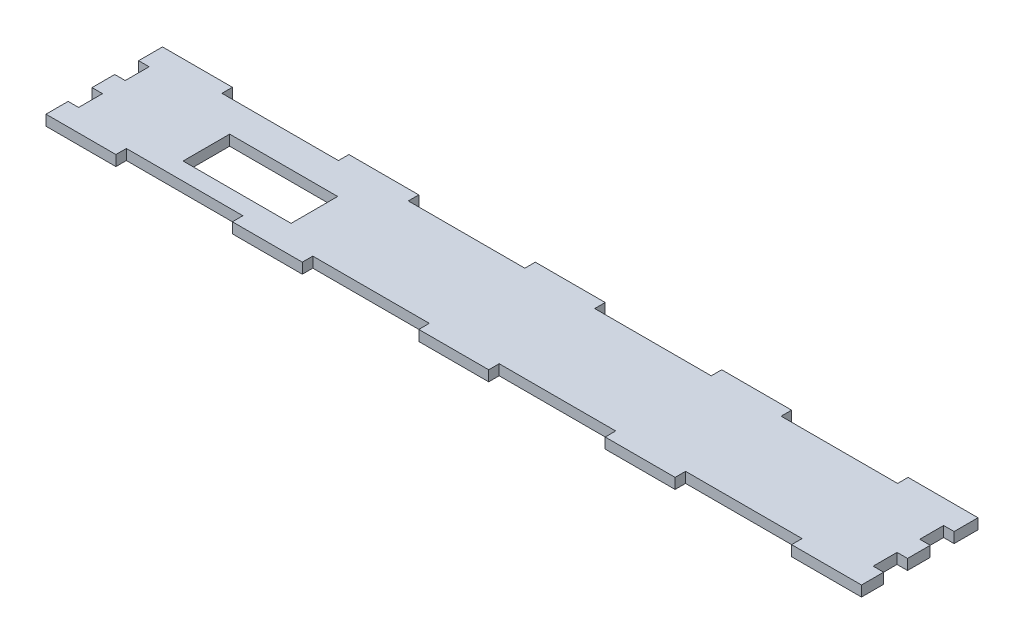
ISO-10303-21;
HEADER;
FILE_DESCRIPTION(('STEP AP214'),'2;1');
FILE_NAME('part.step','',(''),(''),'','','');
FILE_SCHEMA(('AUTOMOTIVE_DESIGN { 1 0 10303 214 1 1 1 1 }'));
ENDSEC;
DATA;
#1=APPLICATION_CONTEXT('core data for automotive mechanical design processes');
#2=APPLICATION_PROTOCOL_DEFINITION('international standard','automotive_design',2000,#1);
#3=PRODUCT_CONTEXT('',#1,'mechanical');
#4=PRODUCT('Part','Part','',(#3));
#5=PRODUCT_RELATED_PRODUCT_CATEGORY('part','',(#4));
#6=PRODUCT_DEFINITION_FORMATION('','',#4);
#7=PRODUCT_DEFINITION_CONTEXT('part definition',#1,'design');
#8=PRODUCT_DEFINITION('design','',#6,#7);
#9=PRODUCT_DEFINITION_SHAPE('','',#8);
#10=(LENGTH_UNIT() NAMED_UNIT(*) SI_UNIT(.MILLI.,.METRE.));
#11=(NAMED_UNIT(*) PLANE_ANGLE_UNIT() SI_UNIT($,.RADIAN.));
#12=(NAMED_UNIT(*) SI_UNIT($,.STERADIAN.) SOLID_ANGLE_UNIT());
#13=UNCERTAINTY_MEASURE_WITH_UNIT(LENGTH_MEASURE(1.E-05),#10,'distance_accuracy_value','');
#14=(GEOMETRIC_REPRESENTATION_CONTEXT(3) GLOBAL_UNCERTAINTY_ASSIGNED_CONTEXT((#13)) GLOBAL_UNIT_ASSIGNED_CONTEXT((#10,
#11,#12)) REPRESENTATION_CONTEXT('',''));
#15=CARTESIAN_POINT('',(0.,0.,0.));
#16=DIRECTION('',(0.,0.,1.));
#17=DIRECTION('',(1.,0.,0.));
#18=AXIS2_PLACEMENT_3D('',#15,#16,#17);
#19=CARTESIAN_POINT('',(-350.,9.,-50.));
#20=DIRECTION('',(0.,0.,1.));
#21=DIRECTION('',(1.,0.,0.));
#22=AXIS2_PLACEMENT_3D('',#19,#20,#21);
#23=PLANE('',#22);
#24=DIRECTION('',(-1.,0.,0.));
#25=VECTOR('',#24,1.);
#26=CARTESIAN_POINT('',(-350.,0.,-50.));
#27=LINE('',#26,#25);
#28=CARTESIAN_POINT('',(30.0000000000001,0.,-50.));
#29=VERTEX_POINT('',#28);
#30=CARTESIAN_POINT('',(-29.9999999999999,0.,-50.));
#31=VERTEX_POINT('',#30);
#32=EDGE_CURVE('E938',#29,#31,#27,.T.);
#33=ORIENTED_EDGE('',*,*,#32,.T.);
#34=DIRECTION('',(0.,1.,0.));
#35=VECTOR('',#34,1.);
#36=CARTESIAN_POINT('',(-29.9999999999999,0.,-50.));
#37=LINE('',#36,#35);
#38=CARTESIAN_POINT('',(-29.9999999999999,9.,-50.));
#39=VERTEX_POINT('',#38);
#40=EDGE_CURVE('E524',#31,#39,#37,.T.);
#41=ORIENTED_EDGE('',*,*,#40,.T.);
#42=DIRECTION('',(-1.,0.,0.));
#43=VECTOR('',#42,1.);
#44=CARTESIAN_POINT('',(-350.,9.,-50.));
#45=LINE('',#44,#43);
#46=CARTESIAN_POINT('',(30.0000000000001,9.,-50.));
#47=VERTEX_POINT('',#46);
#48=EDGE_CURVE('E913',#47,#39,#45,.T.);
#49=ORIENTED_EDGE('',*,*,#48,.F.);
#50=DIRECTION('',(0.,1.,0.));
#51=VECTOR('',#50,1.);
#52=CARTESIAN_POINT('',(30.0000000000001,0.,-50.));
#53=LINE('',#52,#51);
#54=EDGE_CURVE('E543',#29,#47,#53,.T.);
#55=ORIENTED_EDGE('',*,*,#54,.F.);
#56=EDGE_LOOP('',(#33,#41,#49,#55));
#57=FACE_BOUND('',#56,.T.);
#58=ADVANCED_FACE('F37',(#57),#23,.F.);
#59=CARTESIAN_POINT('',(190.,0.,-50.));
#60=VERTEX_POINT('',#59);
#61=CARTESIAN_POINT('',(130.,0.,-50.));
#62=VERTEX_POINT('',#61);
#63=EDGE_CURVE('E707',#60,#62,#27,.T.);
#64=ORIENTED_EDGE('',*,*,#63,.T.);
#65=DIRECTION('',(0.,1.,0.));
#66=VECTOR('',#65,1.);
#67=CARTESIAN_POINT('',(130.,0.,-50.));
#68=LINE('',#67,#66);
#69=CARTESIAN_POINT('',(130.,9.,-50.));
#70=VERTEX_POINT('',#69);
#71=EDGE_CURVE('E520',#62,#70,#68,.T.);
#72=ORIENTED_EDGE('',*,*,#71,.T.);
#73=CARTESIAN_POINT('',(190.,9.,-50.));
#74=VERTEX_POINT('',#73);
#75=EDGE_CURVE('E660',#74,#70,#45,.T.);
#76=ORIENTED_EDGE('',*,*,#75,.F.);
#77=DIRECTION('',(0.,1.,0.));
#78=VECTOR('',#77,1.);
#79=CARTESIAN_POINT('',(190.,0.,-50.));
#80=LINE('',#79,#78);
#81=EDGE_CURVE('E569',#60,#74,#80,.T.);
#82=ORIENTED_EDGE('',*,*,#81,.F.);
#83=EDGE_LOOP('',(#64,#72,#76,#82));
#84=FACE_BOUND('',#83,.T.);
#85=ADVANCED_FACE('F874',(#84),#23,.F.);
#86=CARTESIAN_POINT('',(350.,0.,-50.));
#87=VERTEX_POINT('',#86);
#88=CARTESIAN_POINT('',(290.,0.,-50.));
#89=VERTEX_POINT('',#88);
#90=EDGE_CURVE('E703',#87,#89,#27,.T.);
#91=ORIENTED_EDGE('',*,*,#90,.T.);
#92=DIRECTION('',(0.,1.,0.));
#93=VECTOR('',#92,1.);
#94=CARTESIAN_POINT('',(290.,0.,-50.));
#95=LINE('',#94,#93);
#96=CARTESIAN_POINT('',(290.,9.,-50.));
#97=VERTEX_POINT('',#96);
#98=EDGE_CURVE('E548',#89,#97,#95,.T.);
#99=ORIENTED_EDGE('',*,*,#98,.T.);
#100=CARTESIAN_POINT('',(350.,9.,-50.));
#101=VERTEX_POINT('',#100);
#102=EDGE_CURVE('E656',#101,#97,#45,.T.);
#103=ORIENTED_EDGE('',*,*,#102,.F.);
#104=DIRECTION('',(0.,-1.,0.));
#105=VECTOR('',#104,1.);
#106=CARTESIAN_POINT('',(350.,9.,-50.));
#107=LINE('',#106,#105);
#108=EDGE_CURVE('E761',#101,#87,#107,.T.);
#109=ORIENTED_EDGE('',*,*,#108,.T.);
#110=EDGE_LOOP('',(#91,#99,#103,#109));
#111=FACE_BOUND('',#110,.T.);
#112=ADVANCED_FACE('F881',(#111),#23,.F.);
#113=CARTESIAN_POINT('',(-290.,9.,-50.));
#114=VERTEX_POINT('',#113);
#115=CARTESIAN_POINT('',(-350.,9.,-50.));
#116=VERTEX_POINT('',#115);
#117=EDGE_CURVE('E655',#114,#116,#45,.T.);
#118=ORIENTED_EDGE('',*,*,#117,.F.);
#119=DIRECTION('',(0.,1.,0.));
#120=VECTOR('',#119,1.);
#121=CARTESIAN_POINT('',(-290.,0.,-50.));
#122=LINE('',#121,#120);
#123=CARTESIAN_POINT('',(-290.,0.,-50.));
#124=VERTEX_POINT('',#123);
#125=EDGE_CURVE('E626',#124,#114,#122,.T.);
#126=ORIENTED_EDGE('',*,*,#125,.F.);
#127=CARTESIAN_POINT('',(-350.,0.,-50.));
#128=VERTEX_POINT('',#127);
#129=EDGE_CURVE('E702',#124,#128,#27,.T.);
#130=ORIENTED_EDGE('',*,*,#129,.T.);
#131=DIRECTION('',(0.,-1.,0.));
#132=VECTOR('',#131,1.);
#133=CARTESIAN_POINT('',(-350.,9.,-50.));
#134=LINE('',#133,#132);
#135=EDGE_CURVE('E758',#116,#128,#134,.T.);
#136=ORIENTED_EDGE('',*,*,#135,.F.);
#137=EDGE_LOOP('',(#118,#126,#130,#136));
#138=FACE_BOUND('',#137,.T.);
#139=ADVANCED_FACE('F870',(#138),#23,.F.);
#140=CARTESIAN_POINT('',(-350.,9.,50.));
#141=DIRECTION('',(0.,0.,-1.));
#142=DIRECTION('',(-1.,0.,0.));
#143=AXIS2_PLACEMENT_3D('',#140,#141,#142);
#144=PLANE('',#143);
#145=DIRECTION('',(1.,0.,0.));
#146=VECTOR('',#145,1.);
#147=CARTESIAN_POINT('',(-350.,0.,50.));
#148=LINE('',#147,#146);
#149=CARTESIAN_POINT('',(130.,0.,50.));
#150=VERTEX_POINT('',#149);
#151=CARTESIAN_POINT('',(190.,0.,50.));
#152=VERTEX_POINT('',#151);
#153=EDGE_CURVE('E814',#150,#152,#148,.T.);
#154=ORIENTED_EDGE('',*,*,#153,.T.);
#155=DIRECTION('',(0.,1.,0.));
#156=VECTOR('',#155,1.);
#157=CARTESIAN_POINT('',(190.,0.,50.));
#158=LINE('',#157,#156);
#159=CARTESIAN_POINT('',(190.,9.,50.));
#160=VERTEX_POINT('',#159);
#161=EDGE_CURVE('E595',#152,#160,#158,.T.);
#162=ORIENTED_EDGE('',*,*,#161,.T.);
#163=DIRECTION('',(1.,0.,0.));
#164=VECTOR('',#163,1.);
#165=CARTESIAN_POINT('',(-350.,9.,50.));
#166=LINE('',#165,#164);
#167=CARTESIAN_POINT('',(130.,9.,50.));
#168=VERTEX_POINT('',#167);
#169=EDGE_CURVE('E841',#168,#160,#166,.T.);
#170=ORIENTED_EDGE('',*,*,#169,.F.);
#171=DIRECTION('',(0.,1.,0.));
#172=VECTOR('',#171,1.);
#173=CARTESIAN_POINT('',(130.,0.,50.));
#174=LINE('',#173,#172);
#175=EDGE_CURVE('E451',#150,#168,#174,.T.);
#176=ORIENTED_EDGE('',*,*,#175,.F.);
#177=EDGE_LOOP('',(#154,#162,#170,#176));
#178=FACE_BOUND('',#177,.T.);
#179=ADVANCED_FACE('F855',(#178),#144,.F.);
#180=CARTESIAN_POINT('',(-29.9999999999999,0.,50.));
#181=VERTEX_POINT('',#180);
#182=CARTESIAN_POINT('',(30.0000000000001,0.,50.));
#183=VERTEX_POINT('',#182);
#184=EDGE_CURVE('E816',#181,#183,#148,.T.);
#185=ORIENTED_EDGE('',*,*,#184,.T.);
#186=DIRECTION('',(0.,1.,0.));
#187=VECTOR('',#186,1.);
#188=CARTESIAN_POINT('',(30.0000000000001,0.,50.));
#189=LINE('',#188,#187);
#190=CARTESIAN_POINT('',(30.0000000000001,9.,50.));
#191=VERTEX_POINT('',#190);
#192=EDGE_CURVE('E437',#183,#191,#189,.T.);
#193=ORIENTED_EDGE('',*,*,#192,.T.);
#194=CARTESIAN_POINT('',(-29.9999999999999,9.,50.));
#195=VERTEX_POINT('',#194);
#196=EDGE_CURVE('E839',#195,#191,#166,.T.);
#197=ORIENTED_EDGE('',*,*,#196,.F.);
#198=DIRECTION('',(0.,1.,0.));
#199=VECTOR('',#198,1.);
#200=CARTESIAN_POINT('',(-29.9999999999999,0.,50.));
#201=LINE('',#200,#199);
#202=EDGE_CURVE('E477',#181,#195,#201,.T.);
#203=ORIENTED_EDGE('',*,*,#202,.F.);
#204=EDGE_LOOP('',(#185,#193,#197,#203));
#205=FACE_BOUND('',#204,.T.);
#206=ADVANCED_FACE('F869',(#205),#144,.F.);
#207=CARTESIAN_POINT('',(-190.,0.,50.));
#208=VERTEX_POINT('',#207);
#209=CARTESIAN_POINT('',(-130.,0.,50.));
#210=VERTEX_POINT('',#209);
#211=EDGE_CURVE('E728',#208,#210,#148,.T.);
#212=ORIENTED_EDGE('',*,*,#211,.T.);
#213=DIRECTION('',(0.,1.,0.));
#214=VECTOR('',#213,1.);
#215=CARTESIAN_POINT('',(-130.,0.,50.));
#216=LINE('',#215,#214);
#217=CARTESIAN_POINT('',(-130.,9.,50.));
#218=VERTEX_POINT('',#217);
#219=EDGE_CURVE('E465',#210,#218,#216,.T.);
#220=ORIENTED_EDGE('',*,*,#219,.T.);
#221=CARTESIAN_POINT('',(-190.,9.,50.));
#222=VERTEX_POINT('',#221);
#223=EDGE_CURVE('E683',#222,#218,#166,.T.);
#224=ORIENTED_EDGE('',*,*,#223,.F.);
#225=DIRECTION('',(0.,1.,0.));
#226=VECTOR('',#225,1.);
#227=CARTESIAN_POINT('',(-190.,0.,50.));
#228=LINE('',#227,#226);
#229=EDGE_CURVE('E501',#208,#222,#228,.T.);
#230=ORIENTED_EDGE('',*,*,#229,.F.);
#231=EDGE_LOOP('',(#212,#220,#224,#230));
#232=FACE_BOUND('',#231,.T.);
#233=ADVANCED_FACE('F828',(#232),#144,.F.);
#234=CARTESIAN_POINT('',(-350.,0.,50.));
#235=VERTEX_POINT('',#234);
#236=CARTESIAN_POINT('',(-290.,0.,50.));
#237=VERTEX_POINT('',#236);
#238=EDGE_CURVE('E639',#235,#237,#148,.T.);
#239=ORIENTED_EDGE('',*,*,#238,.T.);
#240=DIRECTION('',(0.,1.,0.));
#241=VECTOR('',#240,1.);
#242=CARTESIAN_POINT('',(-290.,0.,50.));
#243=LINE('',#242,#241);
#244=CARTESIAN_POINT('',(-290.,9.,50.));
#245=VERTEX_POINT('',#244);
#246=EDGE_CURVE('E491',#237,#245,#243,.T.);
#247=ORIENTED_EDGE('',*,*,#246,.T.);
#248=CARTESIAN_POINT('',(-350.,9.,50.));
#249=VERTEX_POINT('',#248);
#250=EDGE_CURVE('E679',#249,#245,#166,.T.);
#251=ORIENTED_EDGE('',*,*,#250,.F.);
#252=DIRECTION('',(0.,-1.,0.));
#253=VECTOR('',#252,1.);
#254=CARTESIAN_POINT('',(-350.,9.,50.));
#255=LINE('',#254,#253);
#256=EDGE_CURVE('E731',#249,#235,#255,.T.);
#257=ORIENTED_EDGE('',*,*,#256,.T.);
#258=EDGE_LOOP('',(#239,#247,#251,#257));
#259=FACE_BOUND('',#258,.T.);
#260=ADVANCED_FACE('F856',(#259),#144,.F.);
#261=CARTESIAN_POINT('',(349.999999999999,9.,31.));
#262=DIRECTION('',(-1.,0.,0.));
#263=DIRECTION('',(0.,0.,1.));
#264=AXIS2_PLACEMENT_3D('',#261,#262,#263);
#265=PLANE('',#264);
#266=DIRECTION('',(0.,0.,-1.));
#267=VECTOR('',#266,1.);
#268=CARTESIAN_POINT('',(349.999999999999,0.,31.));
#269=LINE('',#268,#267);
#270=CARTESIAN_POINT('',(350.,0.,50.));
#271=VERTEX_POINT('',#270);
#272=CARTESIAN_POINT('',(349.999999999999,0.,31.));
#273=VERTEX_POINT('',#272);
#274=EDGE_CURVE('E628',#271,#273,#269,.T.);
#275=ORIENTED_EDGE('',*,*,#274,.T.);
#276=DIRECTION('',(0.,-1.,0.));
#277=VECTOR('',#276,1.);
#278=CARTESIAN_POINT('',(349.999999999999,9.,31.));
#279=LINE('',#278,#277);
#280=CARTESIAN_POINT('',(349.999999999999,9.,31.));
#281=VERTEX_POINT('',#280);
#282=EDGE_CURVE('E11',#281,#273,#279,.T.);
#283=ORIENTED_EDGE('',*,*,#282,.F.);
#284=DIRECTION('',(0.,0.,-1.));
#285=VECTOR('',#284,1.);
#286=CARTESIAN_POINT('',(349.999999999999,9.,31.));
#287=LINE('',#286,#285);
#288=CARTESIAN_POINT('',(350.,9.,50.));
#289=VERTEX_POINT('',#288);
#290=EDGE_CURVE('E635',#289,#281,#287,.T.);
#291=ORIENTED_EDGE('',*,*,#290,.F.);
#292=DIRECTION('',(0.,-1.,0.));
#293=VECTOR('',#292,1.);
#294=CARTESIAN_POINT('',(350.,9.,50.));
#295=LINE('',#294,#293);
#296=EDGE_CURVE('E682',#289,#271,#295,.T.);
#297=ORIENTED_EDGE('',*,*,#296,.T.);
#298=EDGE_LOOP('',(#275,#283,#291,#297));
#299=FACE_BOUND('',#298,.T.);
#300=ADVANCED_FACE('F39',(#299),#265,.F.);
#301=CARTESIAN_POINT('',(349.999999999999,9.,31.));
#302=DIRECTION('',(0.,0.,1.));
#303=DIRECTION('',(1.,0.,0.));
#304=AXIS2_PLACEMENT_3D('',#301,#302,#303);
#305=PLANE('',#304);
#306=DIRECTION('',(-1.,0.,0.));
#307=VECTOR('',#306,1.);
#308=CARTESIAN_POINT('',(349.999999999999,0.,31.));
#309=LINE('',#308,#307);
#310=CARTESIAN_POINT('',(341.,0.,30.9999999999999));
#311=VERTEX_POINT('',#310);
#312=EDGE_CURVE('E686',#273,#311,#309,.T.);
#313=ORIENTED_EDGE('',*,*,#312,.T.);
#314=DIRECTION('',(0.,-1.,0.));
#315=VECTOR('',#314,1.);
#316=CARTESIAN_POINT('',(341.,9.,30.9999999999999));
#317=LINE('',#316,#315);
#318=CARTESIAN_POINT('',(341.,9.,30.9999999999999));
#319=VERTEX_POINT('',#318);
#320=EDGE_CURVE('E45',#319,#311,#317,.T.);
#321=ORIENTED_EDGE('',*,*,#320,.F.);
#322=DIRECTION('',(-1.,0.,0.));
#323=VECTOR('',#322,1.);
#324=CARTESIAN_POINT('',(349.999999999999,9.,31.));
#325=LINE('',#324,#323);
#326=EDGE_CURVE('E638',#281,#319,#325,.T.);
#327=ORIENTED_EDGE('',*,*,#326,.F.);
#328=ORIENTED_EDGE('',*,*,#282,.T.);
#329=EDGE_LOOP('',(#313,#321,#327,#328));
#330=FACE_BOUND('',#329,.T.);
#331=ADVANCED_FACE('F808',(#330),#305,.F.);
#332=CARTESIAN_POINT('',(341.,9.,10.4999999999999));
#333=DIRECTION('',(-1.,0.,0.));
#334=DIRECTION('',(0.,0.,1.));
#335=AXIS2_PLACEMENT_3D('',#332,#333,#334);
#336=PLANE('',#335);
#337=DIRECTION('',(0.,0.,-1.));
#338=VECTOR('',#337,1.);
#339=CARTESIAN_POINT('',(341.,0.,10.4999999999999));
#340=LINE('',#339,#338);
#341=CARTESIAN_POINT('',(341.,0.,10.4999999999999));
#342=VERTEX_POINT('',#341);
#343=EDGE_CURVE('E688',#311,#342,#340,.T.);
#344=ORIENTED_EDGE('',*,*,#343,.T.);
#345=DIRECTION('',(0.,-1.,0.));
#346=VECTOR('',#345,1.);
#347=CARTESIAN_POINT('',(341.,9.,10.4999999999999));
#348=LINE('',#347,#346);
#349=CARTESIAN_POINT('',(341.,9.,10.4999999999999));
#350=VERTEX_POINT('',#349);
#351=EDGE_CURVE('E779',#350,#342,#348,.T.);
#352=ORIENTED_EDGE('',*,*,#351,.F.);
#353=DIRECTION('',(0.,0.,-1.));
#354=VECTOR('',#353,1.);
#355=CARTESIAN_POINT('',(341.,9.,10.4999999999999));
#356=LINE('',#355,#354);
#357=EDGE_CURVE('E641',#319,#350,#356,.T.);
#358=ORIENTED_EDGE('',*,*,#357,.F.);
#359=ORIENTED_EDGE('',*,*,#320,.T.);
#360=EDGE_LOOP('',(#344,#352,#358,#359));
#361=FACE_BOUND('',#360,.T.);
#362=ADVANCED_FACE('F786',(#361),#336,.F.);
#363=CARTESIAN_POINT('',(349.999999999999,9.,10.5));
#364=DIRECTION('',(0.,0.,-1.));
#365=DIRECTION('',(-1.,0.,0.));
#366=AXIS2_PLACEMENT_3D('',#363,#364,#365);
#367=PLANE('',#366);
#368=DIRECTION('',(1.,0.,0.));
#369=VECTOR('',#368,1.);
#370=CARTESIAN_POINT('',(349.999999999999,0.,10.5));
#371=LINE('',#370,#369);
#372=CARTESIAN_POINT('',(349.999999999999,0.,10.5));
#373=VERTEX_POINT('',#372);
#374=EDGE_CURVE('E690',#342,#373,#371,.T.);
#375=ORIENTED_EDGE('',*,*,#374,.T.);
#376=DIRECTION('',(0.,-1.,0.));
#377=VECTOR('',#376,1.);
#378=CARTESIAN_POINT('',(349.999999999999,9.,10.5));
#379=LINE('',#378,#377);
#380=CARTESIAN_POINT('',(349.999999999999,9.,10.5));
#381=VERTEX_POINT('',#380);
#382=EDGE_CURVE('E776',#381,#373,#379,.T.);
#383=ORIENTED_EDGE('',*,*,#382,.F.);
#384=DIRECTION('',(1.,0.,0.));
#385=VECTOR('',#384,1.);
#386=CARTESIAN_POINT('',(349.999999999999,9.,10.5));
#387=LINE('',#386,#385);
#388=EDGE_CURVE('E643',#350,#381,#387,.T.);
#389=ORIENTED_EDGE('',*,*,#388,.F.);
#390=ORIENTED_EDGE('',*,*,#351,.T.);
#391=EDGE_LOOP('',(#375,#383,#389,#390));
#392=FACE_BOUND('',#391,.T.);
#393=ADVANCED_FACE('F795',(#392),#367,.F.);
#394=CARTESIAN_POINT('',(350.,9.,-9.00000000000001));
#395=DIRECTION('',(-1.,0.,0.));
#396=DIRECTION('',(0.,0.,1.));
#397=AXIS2_PLACEMENT_3D('',#394,#395,#396);
#398=PLANE('',#397);
#399=DIRECTION('',(0.,0.,-1.));
#400=VECTOR('',#399,1.);
#401=CARTESIAN_POINT('',(350.,0.,-9.00000000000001));
#402=LINE('',#401,#400);
#403=CARTESIAN_POINT('',(350.,0.,-9.00000000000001));
#404=VERTEX_POINT('',#403);
#405=EDGE_CURVE('E692',#373,#404,#402,.T.);
#406=ORIENTED_EDGE('',*,*,#405,.T.);
#407=DIRECTION('',(0.,-1.,0.));
#408=VECTOR('',#407,1.);
#409=CARTESIAN_POINT('',(350.,9.,-9.00000000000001));
#410=LINE('',#409,#408);
#411=CARTESIAN_POINT('',(350.,9.,-9.00000000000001));
#412=VERTEX_POINT('',#411);
#413=EDGE_CURVE('E773',#412,#404,#410,.T.);
#414=ORIENTED_EDGE('',*,*,#413,.F.);
#415=DIRECTION('',(0.,0.,-1.));
#416=VECTOR('',#415,1.);
#417=CARTESIAN_POINT('',(350.,9.,-9.00000000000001));
#418=LINE('',#417,#416);
#419=EDGE_CURVE('E645',#381,#412,#418,.T.);
#420=ORIENTED_EDGE('',*,*,#419,.F.);
#421=ORIENTED_EDGE('',*,*,#382,.T.);
#422=EDGE_LOOP('',(#406,#414,#420,#421));
#423=FACE_BOUND('',#422,.T.);
#424=ADVANCED_FACE('F799',(#423),#398,.F.);
#425=CARTESIAN_POINT('',(350.,9.,-9.00000000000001));
#426=DIRECTION('',(0.,0.,1.));
#427=DIRECTION('',(1.,0.,0.));
#428=AXIS2_PLACEMENT_3D('',#425,#426,#427);
#429=PLANE('',#428);
#430=DIRECTION('',(-1.,0.,0.));
#431=VECTOR('',#430,1.);
#432=CARTESIAN_POINT('',(350.,0.,-9.00000000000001));
#433=LINE('',#432,#431);
#434=CARTESIAN_POINT('',(341.,0.,-9.0000000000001));
#435=VERTEX_POINT('',#434);
#436=EDGE_CURVE('E694',#404,#435,#433,.T.);
#437=ORIENTED_EDGE('',*,*,#436,.T.);
#438=DIRECTION('',(0.,-1.,0.));
#439=VECTOR('',#438,1.);
#440=CARTESIAN_POINT('',(341.,9.,-9.0000000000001));
#441=LINE('',#440,#439);
#442=CARTESIAN_POINT('',(341.,9.,-9.0000000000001));
#443=VERTEX_POINT('',#442);
#444=EDGE_CURVE('E770',#443,#435,#441,.T.);
#445=ORIENTED_EDGE('',*,*,#444,.F.);
#446=DIRECTION('',(-1.,0.,0.));
#447=VECTOR('',#446,1.);
#448=CARTESIAN_POINT('',(350.,9.,-9.00000000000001));
#449=LINE('',#448,#447);
#450=EDGE_CURVE('E647',#412,#443,#449,.T.);
#451=ORIENTED_EDGE('',*,*,#450,.F.);
#452=ORIENTED_EDGE('',*,*,#413,.T.);
#453=EDGE_LOOP('',(#437,#445,#451,#452));
#454=FACE_BOUND('',#453,.T.);
#455=ADVANCED_FACE('F1344',(#454),#429,.F.);
#456=CARTESIAN_POINT('',(341.,9.,-29.5000000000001));
#457=DIRECTION('',(-1.,0.,0.));
#458=DIRECTION('',(0.,0.,1.));
#459=AXIS2_PLACEMENT_3D('',#456,#457,#458);
#460=PLANE('',#459);
#461=DIRECTION('',(0.,0.,-1.));
#462=VECTOR('',#461,1.);
#463=CARTESIAN_POINT('',(341.,0.,-29.5000000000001));
#464=LINE('',#463,#462);
#465=CARTESIAN_POINT('',(341.,0.,-29.5000000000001));
#466=VERTEX_POINT('',#465);
#467=EDGE_CURVE('E696',#435,#466,#464,.T.);
#468=ORIENTED_EDGE('',*,*,#467,.T.);
#469=DIRECTION('',(0.,-1.,0.));
#470=VECTOR('',#469,1.);
#471=CARTESIAN_POINT('',(341.,9.,-29.5000000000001));
#472=LINE('',#471,#470);
#473=CARTESIAN_POINT('',(341.,9.,-29.5000000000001));
#474=VERTEX_POINT('',#473);
#475=EDGE_CURVE('E767',#474,#466,#472,.T.);
#476=ORIENTED_EDGE('',*,*,#475,.F.);
#477=DIRECTION('',(0.,0.,-1.));
#478=VECTOR('',#477,1.);
#479=CARTESIAN_POINT('',(341.,9.,-29.5000000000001));
#480=LINE('',#479,#478);
#481=EDGE_CURVE('E649',#443,#474,#480,.T.);
#482=ORIENTED_EDGE('',*,*,#481,.F.);
#483=ORIENTED_EDGE('',*,*,#444,.T.);
#484=EDGE_LOOP('',(#468,#476,#482,#483));
#485=FACE_BOUND('',#484,.T.);
#486=ADVANCED_FACE('F1335',(#485),#460,.F.);
#487=CARTESIAN_POINT('',(350.,9.,-29.5));
#488=DIRECTION('',(0.,0.,-1.));
#489=DIRECTION('',(-1.,0.,0.));
#490=AXIS2_PLACEMENT_3D('',#487,#488,#489);
#491=PLANE('',#490);
#492=DIRECTION('',(1.,0.,0.));
#493=VECTOR('',#492,1.);
#494=CARTESIAN_POINT('',(350.,0.,-29.5));
#495=LINE('',#494,#493);
#496=CARTESIAN_POINT('',(350.,0.,-29.5));
#497=VERTEX_POINT('',#496);
#498=EDGE_CURVE('E698',#466,#497,#495,.T.);
#499=ORIENTED_EDGE('',*,*,#498,.T.);
#500=DIRECTION('',(0.,-1.,0.));
#501=VECTOR('',#500,1.);
#502=CARTESIAN_POINT('',(350.,9.,-29.5));
#503=LINE('',#502,#501);
#504=CARTESIAN_POINT('',(350.,9.,-29.5));
#505=VERTEX_POINT('',#504);
#506=EDGE_CURVE('E764',#505,#497,#503,.T.);
#507=ORIENTED_EDGE('',*,*,#506,.F.);
#508=DIRECTION('',(1.,0.,0.));
#509=VECTOR('',#508,1.);
#510=CARTESIAN_POINT('',(350.,9.,-29.5));
#511=LINE('',#510,#509);
#512=EDGE_CURVE('E651',#474,#505,#511,.T.);
#513=ORIENTED_EDGE('',*,*,#512,.F.);
#514=ORIENTED_EDGE('',*,*,#475,.T.);
#515=EDGE_LOOP('',(#499,#507,#513,#514));
#516=FACE_BOUND('',#515,.T.);
#517=ADVANCED_FACE('F896',(#516),#491,.F.);
#518=CARTESIAN_POINT('',(350.,9.,-50.));
#519=DIRECTION('',(-1.,0.,0.));
#520=DIRECTION('',(0.,0.,1.));
#521=AXIS2_PLACEMENT_3D('',#518,#519,#520);
#522=PLANE('',#521);
#523=DIRECTION('',(0.,0.,-1.));
#524=VECTOR('',#523,1.);
#525=CARTESIAN_POINT('',(350.,0.,-50.));
#526=LINE('',#525,#524);
#527=EDGE_CURVE('E700',#497,#87,#526,.T.);
#528=ORIENTED_EDGE('',*,*,#527,.T.);
#529=ORIENTED_EDGE('',*,*,#108,.F.);
#530=DIRECTION('',(0.,0.,-1.));
#531=VECTOR('',#530,1.);
#532=CARTESIAN_POINT('',(350.,9.,-50.));
#533=LINE('',#532,#531);
#534=EDGE_CURVE('E653',#505,#101,#533,.T.);
#535=ORIENTED_EDGE('',*,*,#534,.F.);
#536=ORIENTED_EDGE('',*,*,#506,.T.);
#537=EDGE_LOOP('',(#528,#529,#535,#536));
#538=FACE_BOUND('',#537,.T.);
#539=ADVANCED_FACE('F888',(#538),#522,.F.);
#540=CARTESIAN_POINT('',(-130.,9.,-50.));
#541=VERTEX_POINT('',#540);
#542=CARTESIAN_POINT('',(-190.,9.,-50.));
#543=VERTEX_POINT('',#542);
#544=EDGE_CURVE('E911',#541,#543,#45,.T.);
#545=ORIENTED_EDGE('',*,*,#544,.F.);
#546=DIRECTION('',(0.,1.,0.));
#547=VECTOR('',#546,1.);
#548=CARTESIAN_POINT('',(-130.,0.,-50.));
#549=LINE('',#548,#547);
#550=CARTESIAN_POINT('',(-130.,0.,-50.));
#551=VERTEX_POINT('',#550);
#552=EDGE_CURVE('E515',#551,#541,#549,.T.);
#553=ORIENTED_EDGE('',*,*,#552,.F.);
#554=CARTESIAN_POINT('',(-190.,0.,-50.));
#555=VERTEX_POINT('',#554);
#556=EDGE_CURVE('E951',#551,#555,#27,.T.);
#557=ORIENTED_EDGE('',*,*,#556,.T.);
#558=DIRECTION('',(0.,1.,0.));
#559=VECTOR('',#558,1.);
#560=CARTESIAN_POINT('',(-190.,0.,-50.));
#561=LINE('',#560,#559);
#562=EDGE_CURVE('E629',#555,#543,#561,.T.);
#563=ORIENTED_EDGE('',*,*,#562,.T.);
#564=EDGE_LOOP('',(#545,#553,#557,#563));
#565=FACE_BOUND('',#564,.T.);
#566=ADVANCED_FACE('F877',(#565),#23,.F.);
#567=CARTESIAN_POINT('',(-350.,9.,-50.));
#568=DIRECTION('',(1.,0.,0.));
#569=DIRECTION('',(0.,0.,-1.));
#570=AXIS2_PLACEMENT_3D('',#567,#568,#569);
#571=PLANE('',#570);
#572=DIRECTION('',(0.,0.,1.));
#573=VECTOR('',#572,1.);
#574=CARTESIAN_POINT('',(-350.,0.,-50.));
#575=LINE('',#574,#573);
#576=CARTESIAN_POINT('',(-350.,0.,-29.5));
#577=VERTEX_POINT('',#576);
#578=EDGE_CURVE('E706',#128,#577,#575,.T.);
#579=ORIENTED_EDGE('',*,*,#578,.T.);
#580=DIRECTION('',(0.,-1.,0.));
#581=VECTOR('',#580,1.);
#582=CARTESIAN_POINT('',(-350.,9.,-29.5));
#583=LINE('',#582,#581);
#584=CARTESIAN_POINT('',(-350.,9.,-29.5));
#585=VERTEX_POINT('',#584);
#586=EDGE_CURVE('E755',#585,#577,#583,.T.);
#587=ORIENTED_EDGE('',*,*,#586,.F.);
#588=DIRECTION('',(0.,0.,1.));
#589=VECTOR('',#588,1.);
#590=CARTESIAN_POINT('',(-350.,9.,-50.));
#591=LINE('',#590,#589);
#592=EDGE_CURVE('E659',#116,#585,#591,.T.);
#593=ORIENTED_EDGE('',*,*,#592,.F.);
#594=ORIENTED_EDGE('',*,*,#135,.T.);
#595=EDGE_LOOP('',(#579,#587,#593,#594));
#596=FACE_BOUND('',#595,.T.);
#597=ADVANCED_FACE('F887',(#596),#571,.F.);
#598=CARTESIAN_POINT('',(-350.,9.,-29.5));
#599=DIRECTION('',(0.,0.,-1.));
#600=DIRECTION('',(-1.,0.,0.));
#601=AXIS2_PLACEMENT_3D('',#598,#599,#600);
#602=PLANE('',#601);
#603=DIRECTION('',(1.,0.,0.));
#604=VECTOR('',#603,1.);
#605=CARTESIAN_POINT('',(-350.,0.,-29.5));
#606=LINE('',#605,#604);
#607=CARTESIAN_POINT('',(-341.,0.,-29.5));
#608=VERTEX_POINT('',#607);
#609=EDGE_CURVE('E709',#577,#608,#606,.T.);
#610=ORIENTED_EDGE('',*,*,#609,.T.);
#611=DIRECTION('',(0.,-1.,0.));
#612=VECTOR('',#611,1.);
#613=CARTESIAN_POINT('',(-341.,9.,-29.5));
#614=LINE('',#613,#612);
#615=CARTESIAN_POINT('',(-341.,9.,-29.5));
#616=VERTEX_POINT('',#615);
#617=EDGE_CURVE('E752',#616,#608,#614,.T.);
#618=ORIENTED_EDGE('',*,*,#617,.F.);
#619=DIRECTION('',(1.,0.,0.));
#620=VECTOR('',#619,1.);
#621=CARTESIAN_POINT('',(-350.,9.,-29.5));
#622=LINE('',#621,#620);
#623=EDGE_CURVE('E662',#585,#616,#622,.T.);
#624=ORIENTED_EDGE('',*,*,#623,.F.);
#625=ORIENTED_EDGE('',*,*,#586,.T.);
#626=EDGE_LOOP('',(#610,#618,#624,#625));
#627=FACE_BOUND('',#626,.T.);
#628=ADVANCED_FACE('F894',(#627),#602,.F.);
#629=CARTESIAN_POINT('',(-341.,9.,-29.5));
#630=DIRECTION('',(1.,0.,0.));
#631=DIRECTION('',(0.,0.,-1.));
#632=AXIS2_PLACEMENT_3D('',#629,#630,#631);
#633=PLANE('',#632);
#634=DIRECTION('',(0.,0.,1.));
#635=VECTOR('',#634,1.);
#636=CARTESIAN_POINT('',(-341.,0.,-29.5));
#637=LINE('',#636,#635);
#638=CARTESIAN_POINT('',(-341.,0.,-9.00000000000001));
#639=VERTEX_POINT('',#638);
#640=EDGE_CURVE('E711',#608,#639,#637,.T.);
#641=ORIENTED_EDGE('',*,*,#640,.T.);
#642=DIRECTION('',(0.,-1.,0.));
#643=VECTOR('',#642,1.);
#644=CARTESIAN_POINT('',(-341.,9.,-9.00000000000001));
#645=LINE('',#644,#643);
#646=CARTESIAN_POINT('',(-341.,9.,-9.00000000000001));
#647=VERTEX_POINT('',#646);
#648=EDGE_CURVE('E749',#647,#639,#645,.T.);
#649=ORIENTED_EDGE('',*,*,#648,.F.);
#650=DIRECTION('',(0.,0.,1.));
#651=VECTOR('',#650,1.);
#652=CARTESIAN_POINT('',(-341.,9.,-29.5));
#653=LINE('',#652,#651);
#654=EDGE_CURVE('E664',#616,#647,#653,.T.);
#655=ORIENTED_EDGE('',*,*,#654,.F.);
#656=ORIENTED_EDGE('',*,*,#617,.T.);
#657=EDGE_LOOP('',(#641,#649,#655,#656));
#658=FACE_BOUND('',#657,.T.);
#659=ADVANCED_FACE('F1296',(#658),#633,.F.);
#660=CARTESIAN_POINT('',(-350.,9.,-9.00000000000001));
#661=DIRECTION('',(0.,0.,1.));
#662=DIRECTION('',(1.,0.,0.));
#663=AXIS2_PLACEMENT_3D('',#660,#661,#662);
#664=PLANE('',#663);
#665=DIRECTION('',(-1.,0.,0.));
#666=VECTOR('',#665,1.);
#667=CARTESIAN_POINT('',(-350.,0.,-9.00000000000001));
#668=LINE('',#667,#666);
#669=CARTESIAN_POINT('',(-350.,0.,-9.00000000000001));
#670=VERTEX_POINT('',#669);
#671=EDGE_CURVE('E713',#639,#670,#668,.T.);
#672=ORIENTED_EDGE('',*,*,#671,.T.);
#673=DIRECTION('',(0.,-1.,0.));
#674=VECTOR('',#673,1.);
#675=CARTESIAN_POINT('',(-350.,9.,-9.00000000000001));
#676=LINE('',#675,#674);
#677=CARTESIAN_POINT('',(-350.,9.,-9.00000000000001));
#678=VERTEX_POINT('',#677);
#679=EDGE_CURVE('E746',#678,#670,#676,.T.);
#680=ORIENTED_EDGE('',*,*,#679,.F.);
#681=DIRECTION('',(-1.,0.,0.));
#682=VECTOR('',#681,1.);
#683=CARTESIAN_POINT('',(-350.,9.,-9.00000000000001));
#684=LINE('',#683,#682);
#685=EDGE_CURVE('E666',#647,#678,#684,.T.);
#686=ORIENTED_EDGE('',*,*,#685,.F.);
#687=ORIENTED_EDGE('',*,*,#648,.T.);
#688=EDGE_LOOP('',(#672,#680,#686,#687));
#689=FACE_BOUND('',#688,.T.);
#690=ADVANCED_FACE('F1287',(#689),#664,.F.);
#691=CARTESIAN_POINT('',(-350.,9.,-9.00000000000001));
#692=DIRECTION('',(1.,0.,0.));
#693=DIRECTION('',(0.,0.,-1.));
#694=AXIS2_PLACEMENT_3D('',#691,#692,#693);
#695=PLANE('',#694);
#696=DIRECTION('',(0.,0.,1.));
#697=VECTOR('',#696,1.);
#698=CARTESIAN_POINT('',(-350.,0.,-9.00000000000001));
#699=LINE('',#698,#697);
#700=CARTESIAN_POINT('',(-349.999999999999,0.,10.5));
#701=VERTEX_POINT('',#700);
#702=EDGE_CURVE('E715',#670,#701,#699,.T.);
#703=ORIENTED_EDGE('',*,*,#702,.T.);
#704=DIRECTION('',(0.,-1.,0.));
#705=VECTOR('',#704,1.);
#706=CARTESIAN_POINT('',(-349.999999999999,9.,10.5));
#707=LINE('',#706,#705);
#708=CARTESIAN_POINT('',(-349.999999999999,9.,10.5));
#709=VERTEX_POINT('',#708);
#710=EDGE_CURVE('E743',#709,#701,#707,.T.);
#711=ORIENTED_EDGE('',*,*,#710,.F.);
#712=DIRECTION('',(0.,0.,1.));
#713=VECTOR('',#712,1.);
#714=CARTESIAN_POINT('',(-350.,9.,-9.00000000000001));
#715=LINE('',#714,#713);
#716=EDGE_CURVE('E668',#678,#709,#715,.T.);
#717=ORIENTED_EDGE('',*,*,#716,.F.);
#718=ORIENTED_EDGE('',*,*,#679,.T.);
#719=EDGE_LOOP('',(#703,#711,#717,#718));
#720=FACE_BOUND('',#719,.T.);
#721=ADVANCED_FACE('F1278',(#720),#695,.F.);
#722=CARTESIAN_POINT('',(-349.999999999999,9.,10.5));
#723=DIRECTION('',(0.,0.,-1.));
#724=DIRECTION('',(-1.,0.,0.));
#725=AXIS2_PLACEMENT_3D('',#722,#723,#724);
#726=PLANE('',#725);
#727=DIRECTION('',(1.,0.,0.));
#728=VECTOR('',#727,1.);
#729=CARTESIAN_POINT('',(-349.999999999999,0.,10.5));
#730=LINE('',#729,#728);
#731=CARTESIAN_POINT('',(-341.,0.,10.5));
#732=VERTEX_POINT('',#731);
#733=EDGE_CURVE('E717',#701,#732,#730,.T.);
#734=ORIENTED_EDGE('',*,*,#733,.T.);
#735=DIRECTION('',(0.,-1.,0.));
#736=VECTOR('',#735,1.);
#737=CARTESIAN_POINT('',(-341.,9.,10.5));
#738=LINE('',#737,#736);
#739=CARTESIAN_POINT('',(-341.,9.,10.5));
#740=VERTEX_POINT('',#739);
#741=EDGE_CURVE('E740',#740,#732,#738,.T.);
#742=ORIENTED_EDGE('',*,*,#741,.F.);
#743=DIRECTION('',(1.,0.,0.));
#744=VECTOR('',#743,1.);
#745=CARTESIAN_POINT('',(-349.999999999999,9.,10.5));
#746=LINE('',#745,#744);
#747=EDGE_CURVE('E670',#709,#740,#746,.T.);
#748=ORIENTED_EDGE('',*,*,#747,.F.);
#749=ORIENTED_EDGE('',*,*,#710,.T.);
#750=EDGE_LOOP('',(#734,#742,#748,#749));
#751=FACE_BOUND('',#750,.T.);
#752=ADVANCED_FACE('F1269',(#751),#726,.F.);
#753=CARTESIAN_POINT('',(-341.,9.,10.5));
#754=DIRECTION('',(1.,0.,0.));
#755=DIRECTION('',(0.,0.,-1.));
#756=AXIS2_PLACEMENT_3D('',#753,#754,#755);
#757=PLANE('',#756);
#758=DIRECTION('',(0.,0.,1.));
#759=VECTOR('',#758,1.);
#760=CARTESIAN_POINT('',(-341.,0.,10.5));
#761=LINE('',#760,#759);
#762=CARTESIAN_POINT('',(-341.,0.,31.));
#763=VERTEX_POINT('',#762);
#764=EDGE_CURVE('E719',#732,#763,#761,.T.);
#765=ORIENTED_EDGE('',*,*,#764,.T.);
#766=DIRECTION('',(0.,-1.,0.));
#767=VECTOR('',#766,1.);
#768=CARTESIAN_POINT('',(-341.,9.,31.));
#769=LINE('',#768,#767);
#770=CARTESIAN_POINT('',(-341.,9.,31.));
#771=VERTEX_POINT('',#770);
#772=EDGE_CURVE('E737',#771,#763,#769,.T.);
#773=ORIENTED_EDGE('',*,*,#772,.F.);
#774=DIRECTION('',(0.,0.,1.));
#775=VECTOR('',#774,1.);
#776=CARTESIAN_POINT('',(-341.,9.,10.5));
#777=LINE('',#776,#775);
#778=EDGE_CURVE('E672',#740,#771,#777,.T.);
#779=ORIENTED_EDGE('',*,*,#778,.F.);
#780=ORIENTED_EDGE('',*,*,#741,.T.);
#781=EDGE_LOOP('',(#765,#773,#779,#780));
#782=FACE_BOUND('',#781,.T.);
#783=ADVANCED_FACE('F1260',(#782),#757,.F.);
#784=CARTESIAN_POINT('',(-349.999999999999,9.,31.));
#785=DIRECTION('',(0.,0.,1.));
#786=DIRECTION('',(1.,0.,0.));
#787=AXIS2_PLACEMENT_3D('',#784,#785,#786);
#788=PLANE('',#787);
#789=DIRECTION('',(-1.,0.,0.));
#790=VECTOR('',#789,1.);
#791=CARTESIAN_POINT('',(-349.999999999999,0.,31.));
#792=LINE('',#791,#790);
#793=CARTESIAN_POINT('',(-349.999999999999,0.,31.));
#794=VERTEX_POINT('',#793);
#795=EDGE_CURVE('E721',#763,#794,#792,.T.);
#796=ORIENTED_EDGE('',*,*,#795,.T.);
#797=DIRECTION('',(0.,-1.,0.));
#798=VECTOR('',#797,1.);
#799=CARTESIAN_POINT('',(-349.999999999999,9.,31.));
#800=LINE('',#799,#798);
#801=CARTESIAN_POINT('',(-349.999999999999,9.,31.));
#802=VERTEX_POINT('',#801);
#803=EDGE_CURVE('E734',#802,#794,#800,.T.);
#804=ORIENTED_EDGE('',*,*,#803,.F.);
#805=DIRECTION('',(-1.,0.,0.));
#806=VECTOR('',#805,1.);
#807=CARTESIAN_POINT('',(-349.999999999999,9.,31.));
#808=LINE('',#807,#806);
#809=EDGE_CURVE('E674',#771,#802,#808,.T.);
#810=ORIENTED_EDGE('',*,*,#809,.F.);
#811=ORIENTED_EDGE('',*,*,#772,.T.);
#812=EDGE_LOOP('',(#796,#804,#810,#811));
#813=FACE_BOUND('',#812,.T.);
#814=ADVANCED_FACE('F864',(#813),#788,.F.);
#815=CARTESIAN_POINT('',(-349.999999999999,9.,31.));
#816=DIRECTION('',(1.,0.,0.));
#817=DIRECTION('',(0.,0.,-1.));
#818=AXIS2_PLACEMENT_3D('',#815,#816,#817);
#819=PLANE('',#818);
#820=DIRECTION('',(0.,0.,1.));
#821=VECTOR('',#820,1.);
#822=CARTESIAN_POINT('',(-349.999999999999,0.,31.));
#823=LINE('',#822,#821);
#824=EDGE_CURVE('E723',#794,#235,#823,.T.);
#825=ORIENTED_EDGE('',*,*,#824,.T.);
#826=ORIENTED_EDGE('',*,*,#256,.F.);
#827=DIRECTION('',(0.,0.,1.));
#828=VECTOR('',#827,1.);
#829=CARTESIAN_POINT('',(-349.999999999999,9.,31.));
#830=LINE('',#829,#828);
#831=EDGE_CURVE('E676',#802,#249,#830,.T.);
#832=ORIENTED_EDGE('',*,*,#831,.F.);
#833=ORIENTED_EDGE('',*,*,#803,.T.);
#834=EDGE_LOOP('',(#825,#826,#832,#833));
#835=FACE_BOUND('',#834,.T.);
#836=ADVANCED_FACE('F853',(#835),#819,.F.);
#837=CARTESIAN_POINT('',(290.,9.,50.));
#838=VERTEX_POINT('',#837);
#839=EDGE_CURVE('E678',#838,#289,#166,.T.);
#840=ORIENTED_EDGE('',*,*,#839,.F.);
#841=DIRECTION('',(0.,1.,0.));
#842=VECTOR('',#841,1.);
#843=CARTESIAN_POINT('',(290.,0.,50.));
#844=LINE('',#843,#842);
#845=CARTESIAN_POINT('',(290.,0.,50.));
#846=VERTEX_POINT('',#845);
#847=EDGE_CURVE('E605',#846,#838,#844,.T.);
#848=ORIENTED_EDGE('',*,*,#847,.F.);
#849=EDGE_CURVE('E725',#846,#271,#148,.T.);
#850=ORIENTED_EDGE('',*,*,#849,.T.);
#851=ORIENTED_EDGE('',*,*,#296,.F.);
#852=EDGE_LOOP('',(#840,#848,#850,#851));
#853=FACE_BOUND('',#852,.T.);
#854=ADVANCED_FACE('F851',(#853),#144,.F.);
#855=CARTESIAN_POINT('',(0.,9.,0.));
#856=DIRECTION('',(0.,1.,0.));
#857=DIRECTION('',(0.,0.,1.));
#858=AXIS2_PLACEMENT_3D('',#855,#856,#857);
#859=PLANE('',#858);
#860=DIRECTION('',(0.,0.,1.));
#861=VECTOR('',#860,1.);
#862=CARTESIAN_POINT('',(-256.344536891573,9.,-14.));
#863=LINE('',#862,#861);
#864=CARTESIAN_POINT('',(-256.344536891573,9.,-14.));
#865=VERTEX_POINT('',#864);
#866=CARTESIAN_POINT('',(-256.344536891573,9.,26.));
#867=VERTEX_POINT('',#866);
#868=EDGE_CURVE('E52',#865,#867,#863,.T.);
#869=ORIENTED_EDGE('',*,*,#868,.F.);
#870=DIRECTION('',(-1.,0.,0.));
#871=VECTOR('',#870,1.);
#872=CARTESIAN_POINT('',(-256.344536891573,9.,-14.));
#873=LINE('',#872,#871);
#874=CARTESIAN_POINT('',(-163.644536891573,9.,-14.));
#875=VERTEX_POINT('',#874);
#876=EDGE_CURVE('E408',#875,#865,#873,.T.);
#877=ORIENTED_EDGE('',*,*,#876,.F.);
#878=DIRECTION('',(0.,0.,-1.));
#879=VECTOR('',#878,1.);
#880=CARTESIAN_POINT('',(-163.644536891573,9.,-14.));
#881=LINE('',#880,#879);
#882=CARTESIAN_POINT('',(-163.644536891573,9.,26.));
#883=VERTEX_POINT('',#882);
#884=EDGE_CURVE('E411',#883,#875,#881,.T.);
#885=ORIENTED_EDGE('',*,*,#884,.F.);
#886=DIRECTION('',(1.,0.,0.));
#887=VECTOR('',#886,1.);
#888=CARTESIAN_POINT('',(-256.344536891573,9.,26.));
#889=LINE('',#888,#887);
#890=EDGE_CURVE('E417',#867,#883,#889,.T.);
#891=ORIENTED_EDGE('',*,*,#890,.F.);
#892=EDGE_LOOP('',(#869,#877,#885,#891));
#893=FACE_BOUND('',#892,.T.);
#894=DIRECTION('',(0.,0.,-1.));
#895=VECTOR('',#894,1.);
#896=CARTESIAN_POINT('',(-29.9999999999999,9.,-50.));
#897=LINE('',#896,#895);
#898=CARTESIAN_POINT('',(-29.9999999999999,9.,-41.));
#899=VERTEX_POINT('',#898);
#900=EDGE_CURVE('E509',#899,#39,#897,.T.);
#901=ORIENTED_EDGE('',*,*,#900,.F.);
#902=DIRECTION('',(1.,0.,0.));
#903=VECTOR('',#902,1.);
#904=CARTESIAN_POINT('',(-130.,9.,-41.));
#905=LINE('',#904,#903);
#906=CARTESIAN_POINT('',(-130.,9.,-41.));
#907=VERTEX_POINT('',#906);
#908=EDGE_CURVE('E519',#907,#899,#905,.T.);
#909=ORIENTED_EDGE('',*,*,#908,.F.);
#910=DIRECTION('',(0.,0.,1.));
#911=VECTOR('',#910,1.);
#912=CARTESIAN_POINT('',(-130.,9.,-50.));
#913=LINE('',#912,#911);
#914=EDGE_CURVE('E516',#541,#907,#913,.T.);
#915=ORIENTED_EDGE('',*,*,#914,.F.);
#916=ORIENTED_EDGE('',*,*,#544,.T.);
#917=DIRECTION('',(0.,0.,-1.));
#918=VECTOR('',#917,1.);
#919=CARTESIAN_POINT('',(-190.,9.,-50.));
#920=LINE('',#919,#918);
#921=CARTESIAN_POINT('',(-190.,9.,-41.));
#922=VERTEX_POINT('',#921);
#923=EDGE_CURVE('E613',#922,#543,#920,.T.);
#924=ORIENTED_EDGE('',*,*,#923,.F.);
#925=DIRECTION('',(1.,0.,0.));
#926=VECTOR('',#925,1.);
#927=CARTESIAN_POINT('',(-290.,9.,-41.));
#928=LINE('',#927,#926);
#929=CARTESIAN_POINT('',(-290.,9.,-41.));
#930=VERTEX_POINT('',#929);
#931=EDGE_CURVE('E622',#930,#922,#928,.T.);
#932=ORIENTED_EDGE('',*,*,#931,.F.);
#933=DIRECTION('',(0.,0.,1.));
#934=VECTOR('',#933,1.);
#935=CARTESIAN_POINT('',(-290.,9.,-50.));
#936=LINE('',#935,#934);
#937=EDGE_CURVE('E527',#114,#930,#936,.T.);
#938=ORIENTED_EDGE('',*,*,#937,.F.);
#939=ORIENTED_EDGE('',*,*,#117,.T.);
#940=ORIENTED_EDGE('',*,*,#592,.T.);
#941=ORIENTED_EDGE('',*,*,#623,.T.);
#942=ORIENTED_EDGE('',*,*,#654,.T.);
#943=ORIENTED_EDGE('',*,*,#685,.T.);
#944=ORIENTED_EDGE('',*,*,#716,.T.);
#945=ORIENTED_EDGE('',*,*,#747,.T.);
#946=ORIENTED_EDGE('',*,*,#778,.T.);
#947=ORIENTED_EDGE('',*,*,#809,.T.);
#948=ORIENTED_EDGE('',*,*,#831,.T.);
#949=ORIENTED_EDGE('',*,*,#250,.T.);
#950=DIRECTION('',(0.,0.,1.));
#951=VECTOR('',#950,1.);
#952=CARTESIAN_POINT('',(-290.,9.,50.));
#953=LINE('',#952,#951);
#954=CARTESIAN_POINT('',(-290.,9.,41.));
#955=VERTEX_POINT('',#954);
#956=EDGE_CURVE('E423',#955,#245,#953,.T.);
#957=ORIENTED_EDGE('',*,*,#956,.F.);
#958=DIRECTION('',(-1.,0.,0.));
#959=VECTOR('',#958,1.);
#960=CARTESIAN_POINT('',(-290.,9.,41.));
#961=LINE('',#960,#959);
#962=CARTESIAN_POINT('',(-190.,9.,41.));
#963=VERTEX_POINT('',#962);
#964=EDGE_CURVE('E485',#963,#955,#961,.T.);
#965=ORIENTED_EDGE('',*,*,#964,.F.);
#966=DIRECTION('',(0.,0.,-1.));
#967=VECTOR('',#966,1.);
#968=CARTESIAN_POINT('',(-190.,9.,50.));
#969=LINE('',#968,#967);
#970=EDGE_CURVE('E493',#222,#963,#969,.T.);
#971=ORIENTED_EDGE('',*,*,#970,.F.);
#972=ORIENTED_EDGE('',*,*,#223,.T.);
#973=DIRECTION('',(0.,0.,1.));
#974=VECTOR('',#973,1.);
#975=CARTESIAN_POINT('',(-130.,9.,50.));
#976=LINE('',#975,#974);
#977=CARTESIAN_POINT('',(-130.,9.,41.));
#978=VERTEX_POINT('',#977);
#979=EDGE_CURVE('E466',#978,#218,#976,.T.);
#980=ORIENTED_EDGE('',*,*,#979,.F.);
#981=DIRECTION('',(-1.,0.,0.));
#982=VECTOR('',#981,1.);
#983=CARTESIAN_POINT('',(-130.,9.,41.));
#984=LINE('',#983,#982);
#985=CARTESIAN_POINT('',(-29.9999999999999,9.,41.));
#986=VERTEX_POINT('',#985);
#987=EDGE_CURVE('E459',#986,#978,#984,.T.);
#988=ORIENTED_EDGE('',*,*,#987,.F.);
#989=DIRECTION('',(0.,0.,-1.));
#990=VECTOR('',#989,1.);
#991=CARTESIAN_POINT('',(-29.9999999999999,9.,50.));
#992=LINE('',#991,#990);
#993=EDGE_CURVE('E468',#195,#986,#992,.T.);
#994=ORIENTED_EDGE('',*,*,#993,.F.);
#995=ORIENTED_EDGE('',*,*,#196,.T.);
#996=DIRECTION('',(0.,0.,1.));
#997=VECTOR('',#996,1.);
#998=CARTESIAN_POINT('',(30.0000000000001,9.,50.));
#999=LINE('',#998,#997);
#1000=CARTESIAN_POINT('',(30.,9.,41.));
#1001=VERTEX_POINT('',#1000);
#1002=EDGE_CURVE('E438',#1001,#191,#999,.T.);
#1003=ORIENTED_EDGE('',*,*,#1002,.F.);
#1004=DIRECTION('',(-1.,0.,0.));
#1005=VECTOR('',#1004,1.);
#1006=CARTESIAN_POINT('',(30.,9.,41.));
#1007=LINE('',#1006,#1005);
#1008=CARTESIAN_POINT('',(130.,9.,41.));
#1009=VERTEX_POINT('',#1008);
#1010=EDGE_CURVE('E431',#1009,#1001,#1007,.T.);
#1011=ORIENTED_EDGE('',*,*,#1010,.F.);
#1012=DIRECTION('',(0.,0.,-1.));
#1013=VECTOR('',#1012,1.);
#1014=CARTESIAN_POINT('',(130.,9.,50.));
#1015=LINE('',#1014,#1013);
#1016=EDGE_CURVE('E440',#168,#1009,#1015,.T.);
#1017=ORIENTED_EDGE('',*,*,#1016,.F.);
#1018=ORIENTED_EDGE('',*,*,#169,.T.);
#1019=DIRECTION('',(0.,0.,1.));
#1020=VECTOR('',#1019,1.);
#1021=CARTESIAN_POINT('',(190.,9.,50.));
#1022=LINE('',#1021,#1020);
#1023=CARTESIAN_POINT('',(190.,9.,41.));
#1024=VERTEX_POINT('',#1023);
#1025=EDGE_CURVE('E448',#1024,#160,#1022,.T.);
#1026=ORIENTED_EDGE('',*,*,#1025,.F.);
#1027=DIRECTION('',(-1.,0.,0.));
#1028=VECTOR('',#1027,1.);
#1029=CARTESIAN_POINT('',(190.,9.,41.));
#1030=LINE('',#1029,#1028);
#1031=CARTESIAN_POINT('',(290.,9.,41.));
#1032=VERTEX_POINT('',#1031);
#1033=EDGE_CURVE('E589',#1032,#1024,#1030,.T.);
#1034=ORIENTED_EDGE('',*,*,#1033,.F.);
#1035=DIRECTION('',(0.,0.,-1.));
#1036=VECTOR('',#1035,1.);
#1037=CARTESIAN_POINT('',(290.,9.,50.));
#1038=LINE('',#1037,#1036);
#1039=EDGE_CURVE('E597',#838,#1032,#1038,.T.);
#1040=ORIENTED_EDGE('',*,*,#1039,.F.);
#1041=ORIENTED_EDGE('',*,*,#839,.T.);
#1042=ORIENTED_EDGE('',*,*,#290,.T.);
#1043=ORIENTED_EDGE('',*,*,#326,.T.);
#1044=ORIENTED_EDGE('',*,*,#357,.T.);
#1045=ORIENTED_EDGE('',*,*,#388,.T.);
#1046=ORIENTED_EDGE('',*,*,#419,.T.);
#1047=ORIENTED_EDGE('',*,*,#450,.T.);
#1048=ORIENTED_EDGE('',*,*,#481,.T.);
#1049=ORIENTED_EDGE('',*,*,#512,.T.);
#1050=ORIENTED_EDGE('',*,*,#534,.T.);
#1051=ORIENTED_EDGE('',*,*,#102,.T.);
#1052=DIRECTION('',(0.,0.,-1.));
#1053=VECTOR('',#1052,1.);
#1054=CARTESIAN_POINT('',(290.,9.,-50.));
#1055=LINE('',#1054,#1053);
#1056=CARTESIAN_POINT('',(290.,9.,-41.));
#1057=VERTEX_POINT('',#1056);
#1058=EDGE_CURVE('E563',#1057,#97,#1055,.T.);
#1059=ORIENTED_EDGE('',*,*,#1058,.F.);
#1060=DIRECTION('',(1.,0.,0.));
#1061=VECTOR('',#1060,1.);
#1062=CARTESIAN_POINT('',(190.,9.,-41.));
#1063=LINE('',#1062,#1061);
#1064=CARTESIAN_POINT('',(190.,9.,-41.));
#1065=VERTEX_POINT('',#1064);
#1066=EDGE_CURVE('E573',#1065,#1057,#1063,.T.);
#1067=ORIENTED_EDGE('',*,*,#1066,.F.);
#1068=DIRECTION('',(0.,0.,1.));
#1069=VECTOR('',#1068,1.);
#1070=CARTESIAN_POINT('',(190.,9.,-50.));
#1071=LINE('',#1070,#1069);
#1072=EDGE_CURVE('E570',#74,#1065,#1071,.T.);
#1073=ORIENTED_EDGE('',*,*,#1072,.F.);
#1074=ORIENTED_EDGE('',*,*,#75,.T.);
#1075=DIRECTION('',(0.,0.,-1.));
#1076=VECTOR('',#1075,1.);
#1077=CARTESIAN_POINT('',(130.,9.,-50.));
#1078=LINE('',#1077,#1076);
#1079=CARTESIAN_POINT('',(130.,9.,-41.));
#1080=VERTEX_POINT('',#1079);
#1081=EDGE_CURVE('E537',#1080,#70,#1078,.T.);
#1082=ORIENTED_EDGE('',*,*,#1081,.F.);
#1083=DIRECTION('',(1.,0.,0.));
#1084=VECTOR('',#1083,1.);
#1085=CARTESIAN_POINT('',(30.,9.,-41.));
#1086=LINE('',#1085,#1084);
#1087=CARTESIAN_POINT('',(30.,9.,-41.));
#1088=VERTEX_POINT('',#1087);
#1089=EDGE_CURVE('E547',#1088,#1080,#1086,.T.);
#1090=ORIENTED_EDGE('',*,*,#1089,.F.);
#1091=DIRECTION('',(0.,0.,1.));
#1092=VECTOR('',#1091,1.);
#1093=CARTESIAN_POINT('',(30.0000000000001,9.,-50.));
#1094=LINE('',#1093,#1092);
#1095=EDGE_CURVE('E544',#47,#1088,#1094,.T.);
#1096=ORIENTED_EDGE('',*,*,#1095,.F.);
#1097=ORIENTED_EDGE('',*,*,#48,.T.);
#1098=EDGE_LOOP('',(#901,#909,#915,#916,#924,#932,#938,#939,#940,#941,#942,#943,#944,#945,#946,
#947,#948,#949,#957,#965,#971,#972,#980,#988,#994,#995,#1003,#1011,#1017,#1018,#1026,#1034,
#1040,#1041,#1042,#1043,#1044,#1045,#1046,#1047,#1048,#1049,#1050,#1051,#1059,#1067,#1073,#1074,
#1082,#1090,#1096,#1097));
#1099=FACE_BOUND('',#1098,.T.);
#1100=ADVANCED_FACE('F804',(#893,#1099),#859,.T.);
#1101=CARTESIAN_POINT('',(0.,0.,0.));
#1102=DIRECTION('',(0.,1.,0.));
#1103=DIRECTION('',(0.,0.,1.));
#1104=AXIS2_PLACEMENT_3D('',#1101,#1102,#1103);
#1105=PLANE('',#1104);
#1106=DIRECTION('',(-1.,0.,0.));
#1107=VECTOR('',#1106,1.);
#1108=CARTESIAN_POINT('',(-256.344536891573,0.,-14.));
#1109=LINE('',#1108,#1107);
#1110=CARTESIAN_POINT('',(-163.644536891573,0.,-14.));
#1111=VERTEX_POINT('',#1110);
#1112=CARTESIAN_POINT('',(-256.344536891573,0.,-14.));
#1113=VERTEX_POINT('',#1112);
#1114=EDGE_CURVE('E398',#1111,#1113,#1109,.T.);
#1115=ORIENTED_EDGE('',*,*,#1114,.T.);
#1116=DIRECTION('',(0.,0.,1.));
#1117=VECTOR('',#1116,1.);
#1118=CARTESIAN_POINT('',(-256.344536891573,0.,-14.));
#1119=LINE('',#1118,#1117);
#1120=CARTESIAN_POINT('',(-256.344536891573,0.,26.));
#1121=VERTEX_POINT('',#1120);
#1122=EDGE_CURVE('E392',#1113,#1121,#1119,.T.);
#1123=ORIENTED_EDGE('',*,*,#1122,.T.);
#1124=DIRECTION('',(1.,0.,0.));
#1125=VECTOR('',#1124,1.);
#1126=CARTESIAN_POINT('',(-256.344536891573,0.,26.));
#1127=LINE('',#1126,#1125);
#1128=CARTESIAN_POINT('',(-163.644536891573,0.,26.));
#1129=VERTEX_POINT('',#1128);
#1130=EDGE_CURVE('E401',#1121,#1129,#1127,.T.);
#1131=ORIENTED_EDGE('',*,*,#1130,.T.);
#1132=DIRECTION('',(0.,0.,-1.));
#1133=VECTOR('',#1132,1.);
#1134=CARTESIAN_POINT('',(-163.644536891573,0.,-14.));
#1135=LINE('',#1134,#1133);
#1136=EDGE_CURVE('E60',#1129,#1111,#1135,.T.);
#1137=ORIENTED_EDGE('',*,*,#1136,.T.);
#1138=EDGE_LOOP('',(#1115,#1123,#1131,#1137));
#1139=FACE_BOUND('',#1138,.T.);
#1140=DIRECTION('',(1.,0.,0.));
#1141=VECTOR('',#1140,1.);
#1142=CARTESIAN_POINT('',(-130.,0.,-41.));
#1143=LINE('',#1142,#1141);
#1144=CARTESIAN_POINT('',(-130.,0.,-41.));
#1145=VERTEX_POINT('',#1144);
#1146=CARTESIAN_POINT('',(-29.9999999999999,0.,-41.));
#1147=VERTEX_POINT('',#1146);
#1148=EDGE_CURVE('E508',#1145,#1147,#1143,.T.);
#1149=ORIENTED_EDGE('',*,*,#1148,.T.);
#1150=DIRECTION('',(0.,0.,-1.));
#1151=VECTOR('',#1150,1.);
#1152=CARTESIAN_POINT('',(-29.9999999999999,0.,-50.));
#1153=LINE('',#1152,#1151);
#1154=EDGE_CURVE('E512',#1147,#31,#1153,.T.);
#1155=ORIENTED_EDGE('',*,*,#1154,.T.);
#1156=ORIENTED_EDGE('',*,*,#32,.F.);
#1157=DIRECTION('',(0.,0.,1.));
#1158=VECTOR('',#1157,1.);
#1159=CARTESIAN_POINT('',(30.0000000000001,0.,-50.));
#1160=LINE('',#1159,#1158);
#1161=CARTESIAN_POINT('',(30.,0.,-41.));
#1162=VERTEX_POINT('',#1161);
#1163=EDGE_CURVE('E533',#29,#1162,#1160,.T.);
#1164=ORIENTED_EDGE('',*,*,#1163,.T.);
#1165=DIRECTION('',(1.,0.,0.));
#1166=VECTOR('',#1165,1.);
#1167=CARTESIAN_POINT('',(30.,0.,-41.));
#1168=LINE('',#1167,#1166);
#1169=CARTESIAN_POINT('',(130.,0.,-41.));
#1170=VERTEX_POINT('',#1169);
#1171=EDGE_CURVE('E536',#1162,#1170,#1168,.T.);
#1172=ORIENTED_EDGE('',*,*,#1171,.T.);
#1173=DIRECTION('',(0.,0.,-1.));
#1174=VECTOR('',#1173,1.);
#1175=CARTESIAN_POINT('',(130.,0.,-50.));
#1176=LINE('',#1175,#1174);
#1177=EDGE_CURVE('E540',#1170,#62,#1176,.T.);
#1178=ORIENTED_EDGE('',*,*,#1177,.T.);
#1179=ORIENTED_EDGE('',*,*,#63,.F.);
#1180=DIRECTION('',(0.,0.,1.));
#1181=VECTOR('',#1180,1.);
#1182=CARTESIAN_POINT('',(190.,0.,-50.));
#1183=LINE('',#1182,#1181);
#1184=CARTESIAN_POINT('',(190.,0.,-41.));
#1185=VERTEX_POINT('',#1184);
#1186=EDGE_CURVE('E559',#60,#1185,#1183,.T.);
#1187=ORIENTED_EDGE('',*,*,#1186,.T.);
#1188=DIRECTION('',(1.,0.,0.));
#1189=VECTOR('',#1188,1.);
#1190=CARTESIAN_POINT('',(190.,0.,-41.));
#1191=LINE('',#1190,#1189);
#1192=CARTESIAN_POINT('',(290.,0.,-41.));
#1193=VERTEX_POINT('',#1192);
#1194=EDGE_CURVE('E562',#1185,#1193,#1191,.T.);
#1195=ORIENTED_EDGE('',*,*,#1194,.T.);
#1196=DIRECTION('',(0.,0.,-1.));
#1197=VECTOR('',#1196,1.);
#1198=CARTESIAN_POINT('',(290.,0.,-50.));
#1199=LINE('',#1198,#1197);
#1200=EDGE_CURVE('E566',#1193,#89,#1199,.T.);
#1201=ORIENTED_EDGE('',*,*,#1200,.T.);
#1202=ORIENTED_EDGE('',*,*,#90,.F.);
#1203=ORIENTED_EDGE('',*,*,#527,.F.);
#1204=ORIENTED_EDGE('',*,*,#498,.F.);
#1205=ORIENTED_EDGE('',*,*,#467,.F.);
#1206=ORIENTED_EDGE('',*,*,#436,.F.);
#1207=ORIENTED_EDGE('',*,*,#405,.F.);
#1208=ORIENTED_EDGE('',*,*,#374,.F.);
#1209=ORIENTED_EDGE('',*,*,#343,.F.);
#1210=ORIENTED_EDGE('',*,*,#312,.F.);
#1211=ORIENTED_EDGE('',*,*,#274,.F.);
#1212=ORIENTED_EDGE('',*,*,#849,.F.);
#1213=DIRECTION('',(0.,0.,-1.));
#1214=VECTOR('',#1213,1.);
#1215=CARTESIAN_POINT('',(290.,0.,50.));
#1216=LINE('',#1215,#1214);
#1217=CARTESIAN_POINT('',(290.,0.,41.));
#1218=VERTEX_POINT('',#1217);
#1219=EDGE_CURVE('E588',#846,#1218,#1216,.T.);
#1220=ORIENTED_EDGE('',*,*,#1219,.T.);
#1221=DIRECTION('',(-1.,0.,0.));
#1222=VECTOR('',#1221,1.);
#1223=CARTESIAN_POINT('',(190.,0.,41.));
#1224=LINE('',#1223,#1222);
#1225=CARTESIAN_POINT('',(190.,0.,41.));
#1226=VERTEX_POINT('',#1225);
#1227=EDGE_CURVE('E592',#1218,#1226,#1224,.T.);
#1228=ORIENTED_EDGE('',*,*,#1227,.T.);
#1229=DIRECTION('',(0.,0.,1.));
#1230=VECTOR('',#1229,1.);
#1231=CARTESIAN_POINT('',(190.,0.,50.));
#1232=LINE('',#1231,#1230);
#1233=EDGE_CURVE('E585',#1226,#152,#1232,.T.);
#1234=ORIENTED_EDGE('',*,*,#1233,.T.);
#1235=ORIENTED_EDGE('',*,*,#153,.F.);
#1236=DIRECTION('',(0.,0.,-1.));
#1237=VECTOR('',#1236,1.);
#1238=CARTESIAN_POINT('',(130.,0.,50.));
#1239=LINE('',#1238,#1237);
#1240=CARTESIAN_POINT('',(130.,0.,41.));
#1241=VERTEX_POINT('',#1240);
#1242=EDGE_CURVE('E430',#150,#1241,#1239,.T.);
#1243=ORIENTED_EDGE('',*,*,#1242,.T.);
#1244=DIRECTION('',(-1.,0.,0.));
#1245=VECTOR('',#1244,1.);
#1246=CARTESIAN_POINT('',(30.,0.,41.));
#1247=LINE('',#1246,#1245);
#1248=CARTESIAN_POINT('',(30.,0.,41.));
#1249=VERTEX_POINT('',#1248);
#1250=EDGE_CURVE('E434',#1241,#1249,#1247,.T.);
#1251=ORIENTED_EDGE('',*,*,#1250,.T.);
#1252=DIRECTION('',(0.,0.,1.));
#1253=VECTOR('',#1252,1.);
#1254=CARTESIAN_POINT('',(30.0000000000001,0.,50.));
#1255=LINE('',#1254,#1253);
#1256=EDGE_CURVE('E427',#1249,#183,#1255,.T.);
#1257=ORIENTED_EDGE('',*,*,#1256,.T.);
#1258=ORIENTED_EDGE('',*,*,#184,.F.);
#1259=DIRECTION('',(0.,0.,-1.));
#1260=VECTOR('',#1259,1.);
#1261=CARTESIAN_POINT('',(-29.9999999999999,0.,50.));
#1262=LINE('',#1261,#1260);
#1263=CARTESIAN_POINT('',(-29.9999999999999,0.,41.));
#1264=VERTEX_POINT('',#1263);
#1265=EDGE_CURVE('E458',#181,#1264,#1262,.T.);
#1266=ORIENTED_EDGE('',*,*,#1265,.T.);
#1267=DIRECTION('',(-1.,0.,0.));
#1268=VECTOR('',#1267,1.);
#1269=CARTESIAN_POINT('',(-130.,0.,41.));
#1270=LINE('',#1269,#1268);
#1271=CARTESIAN_POINT('',(-130.,0.,41.));
#1272=VERTEX_POINT('',#1271);
#1273=EDGE_CURVE('E462',#1264,#1272,#1270,.T.);
#1274=ORIENTED_EDGE('',*,*,#1273,.T.);
#1275=DIRECTION('',(0.,0.,1.));
#1276=VECTOR('',#1275,1.);
#1277=CARTESIAN_POINT('',(-130.,0.,50.));
#1278=LINE('',#1277,#1276);
#1279=EDGE_CURVE('E455',#1272,#210,#1278,.T.);
#1280=ORIENTED_EDGE('',*,*,#1279,.T.);
#1281=ORIENTED_EDGE('',*,*,#211,.F.);
#1282=DIRECTION('',(0.,0.,-1.));
#1283=VECTOR('',#1282,1.);
#1284=CARTESIAN_POINT('',(-190.,0.,50.));
#1285=LINE('',#1284,#1283);
#1286=CARTESIAN_POINT('',(-190.,0.,41.));
#1287=VERTEX_POINT('',#1286);
#1288=EDGE_CURVE('E484',#208,#1287,#1285,.T.);
#1289=ORIENTED_EDGE('',*,*,#1288,.T.);
#1290=DIRECTION('',(-1.,0.,0.));
#1291=VECTOR('',#1290,1.);
#1292=CARTESIAN_POINT('',(-290.,0.,41.));
#1293=LINE('',#1292,#1291);
#1294=CARTESIAN_POINT('',(-290.,0.,41.));
#1295=VERTEX_POINT('',#1294);
#1296=EDGE_CURVE('E488',#1287,#1295,#1293,.T.);
#1297=ORIENTED_EDGE('',*,*,#1296,.T.);
#1298=DIRECTION('',(0.,0.,1.));
#1299=VECTOR('',#1298,1.);
#1300=CARTESIAN_POINT('',(-290.,0.,50.));
#1301=LINE('',#1300,#1299);
#1302=EDGE_CURVE('E481',#1295,#237,#1301,.T.);
#1303=ORIENTED_EDGE('',*,*,#1302,.T.);
#1304=ORIENTED_EDGE('',*,*,#238,.F.);
#1305=ORIENTED_EDGE('',*,*,#824,.F.);
#1306=ORIENTED_EDGE('',*,*,#795,.F.);
#1307=ORIENTED_EDGE('',*,*,#764,.F.);
#1308=ORIENTED_EDGE('',*,*,#733,.F.);
#1309=ORIENTED_EDGE('',*,*,#702,.F.);
#1310=ORIENTED_EDGE('',*,*,#671,.F.);
#1311=ORIENTED_EDGE('',*,*,#640,.F.);
#1312=ORIENTED_EDGE('',*,*,#609,.F.);
#1313=ORIENTED_EDGE('',*,*,#578,.F.);
#1314=ORIENTED_EDGE('',*,*,#129,.F.);
#1315=DIRECTION('',(0.,0.,1.));
#1316=VECTOR('',#1315,1.);
#1317=CARTESIAN_POINT('',(-290.,0.,-50.));
#1318=LINE('',#1317,#1316);
#1319=CARTESIAN_POINT('',(-290.,0.,-41.));
#1320=VERTEX_POINT('',#1319);
#1321=EDGE_CURVE('E609',#124,#1320,#1318,.T.);
#1322=ORIENTED_EDGE('',*,*,#1321,.T.);
#1323=DIRECTION('',(1.,0.,0.));
#1324=VECTOR('',#1323,1.);
#1325=CARTESIAN_POINT('',(-290.,0.,-41.));
#1326=LINE('',#1325,#1324);
#1327=CARTESIAN_POINT('',(-190.,0.,-41.));
#1328=VERTEX_POINT('',#1327);
#1329=EDGE_CURVE('E612',#1320,#1328,#1326,.T.);
#1330=ORIENTED_EDGE('',*,*,#1329,.T.);
#1331=DIRECTION('',(0.,0.,-1.));
#1332=VECTOR('',#1331,1.);
#1333=CARTESIAN_POINT('',(-190.,0.,-50.));
#1334=LINE('',#1333,#1332);
#1335=EDGE_CURVE('E616',#1328,#555,#1334,.T.);
#1336=ORIENTED_EDGE('',*,*,#1335,.T.);
#1337=ORIENTED_EDGE('',*,*,#556,.F.);
#1338=DIRECTION('',(0.,0.,1.));
#1339=VECTOR('',#1338,1.);
#1340=CARTESIAN_POINT('',(-130.,0.,-50.));
#1341=LINE('',#1340,#1339);
#1342=EDGE_CURVE('E505',#551,#1145,#1341,.T.);
#1343=ORIENTED_EDGE('',*,*,#1342,.T.);
#1344=EDGE_LOOP('',(#1149,#1155,#1156,#1164,#1172,#1178,#1179,#1187,#1195,#1201,#1202,#1203,
#1204,#1205,#1206,#1207,#1208,#1209,#1210,#1211,#1212,#1220,#1228,#1234,#1235,#1243,#1251,#1257,
#1258,#1266,#1274,#1280,#1281,#1289,#1297,#1303,#1304,#1305,#1306,#1307,#1308,#1309,#1310,#1311,
#1312,#1313,#1314,#1322,#1330,#1336,#1337,#1343));
#1345=FACE_BOUND('',#1344,.T.);
#1346=ADVANCED_FACE('F405',(#1139,#1345),#1105,.F.);
#1347=CARTESIAN_POINT('',(-290.,0.,-50.));
#1348=DIRECTION('',(-1.,0.,0.));
#1349=DIRECTION('',(0.,0.,1.));
#1350=AXIS2_PLACEMENT_3D('',#1347,#1348,#1349);
#1351=PLANE('',#1350);
#1352=ORIENTED_EDGE('',*,*,#937,.T.);
#1353=DIRECTION('',(0.,1.,0.));
#1354=VECTOR('',#1353,1.);
#1355=CARTESIAN_POINT('',(-290.,0.,-41.));
#1356=LINE('',#1355,#1354);
#1357=EDGE_CURVE('E619',#1320,#930,#1356,.T.);
#1358=ORIENTED_EDGE('',*,*,#1357,.F.);
#1359=ORIENTED_EDGE('',*,*,#1321,.F.);
#1360=ORIENTED_EDGE('',*,*,#125,.T.);
#1361=EDGE_LOOP('',(#1352,#1358,#1359,#1360));
#1362=FACE_BOUND('',#1361,.T.);
#1363=ADVANCED_FACE('F960',(#1362),#1351,.F.);
#1364=CARTESIAN_POINT('',(-190.,0.,-50.));
#1365=DIRECTION('',(1.,0.,0.));
#1366=DIRECTION('',(0.,0.,-1.));
#1367=AXIS2_PLACEMENT_3D('',#1364,#1365,#1366);
#1368=PLANE('',#1367);
#1369=ORIENTED_EDGE('',*,*,#923,.T.);
#1370=ORIENTED_EDGE('',*,*,#562,.F.);
#1371=ORIENTED_EDGE('',*,*,#1335,.F.);
#1372=DIRECTION('',(0.,1.,0.));
#1373=VECTOR('',#1372,1.);
#1374=CARTESIAN_POINT('',(-190.,0.,-41.));
#1375=LINE('',#1374,#1373);
#1376=EDGE_CURVE('E632',#1328,#922,#1375,.T.);
#1377=ORIENTED_EDGE('',*,*,#1376,.T.);
#1378=EDGE_LOOP('',(#1369,#1370,#1371,#1377));
#1379=FACE_BOUND('',#1378,.T.);
#1380=ADVANCED_FACE('F953',(#1379),#1368,.F.);
#1381=CARTESIAN_POINT('',(-290.,0.,-41.));
#1382=DIRECTION('',(0.,0.,1.));
#1383=DIRECTION('',(1.,0.,0.));
#1384=AXIS2_PLACEMENT_3D('',#1381,#1382,#1383);
#1385=PLANE('',#1384);
#1386=ORIENTED_EDGE('',*,*,#931,.T.);
#1387=ORIENTED_EDGE('',*,*,#1376,.F.);
#1388=ORIENTED_EDGE('',*,*,#1329,.F.);
#1389=ORIENTED_EDGE('',*,*,#1357,.T.);
#1390=EDGE_LOOP('',(#1386,#1387,#1388,#1389));
#1391=FACE_BOUND('',#1390,.T.);
#1392=ADVANCED_FACE('F957',(#1391),#1385,.F.);
#1393=CARTESIAN_POINT('',(-290.,0.,50.));
#1394=DIRECTION('',(-1.,0.,0.));
#1395=DIRECTION('',(0.,0.,1.));
#1396=AXIS2_PLACEMENT_3D('',#1393,#1394,#1395);
#1397=PLANE('',#1396);
#1398=ORIENTED_EDGE('',*,*,#956,.T.);
#1399=ORIENTED_EDGE('',*,*,#246,.F.);
#1400=ORIENTED_EDGE('',*,*,#1302,.F.);
#1401=DIRECTION('',(0.,1.,0.));
#1402=VECTOR('',#1401,1.);
#1403=CARTESIAN_POINT('',(-290.,0.,41.));
#1404=LINE('',#1403,#1402);
#1405=EDGE_CURVE('E469',#1295,#955,#1404,.T.);
#1406=ORIENTED_EDGE('',*,*,#1405,.T.);
#1407=EDGE_LOOP('',(#1398,#1399,#1400,#1406));
#1408=FACE_BOUND('',#1407,.T.);
#1409=ADVANCED_FACE('F971',(#1408),#1397,.F.);
#1410=CARTESIAN_POINT('',(-290.,0.,41.));
#1411=DIRECTION('',(0.,0.,-1.));
#1412=DIRECTION('',(-1.,0.,0.));
#1413=AXIS2_PLACEMENT_3D('',#1410,#1411,#1412);
#1414=PLANE('',#1413);
#1415=ORIENTED_EDGE('',*,*,#964,.T.);
#1416=ORIENTED_EDGE('',*,*,#1405,.F.);
#1417=ORIENTED_EDGE('',*,*,#1296,.F.);
#1418=DIRECTION('',(0.,1.,0.));
#1419=VECTOR('',#1418,1.);
#1420=CARTESIAN_POINT('',(-190.,0.,41.));
#1421=LINE('',#1420,#1419);
#1422=EDGE_CURVE('E499',#1287,#963,#1421,.T.);
#1423=ORIENTED_EDGE('',*,*,#1422,.T.);
#1424=EDGE_LOOP('',(#1415,#1416,#1417,#1423));
#1425=FACE_BOUND('',#1424,.T.);
#1426=ADVANCED_FACE('F1012',(#1425),#1414,.F.);
#1427=CARTESIAN_POINT('',(-190.,0.,50.));
#1428=DIRECTION('',(1.,0.,0.));
#1429=DIRECTION('',(0.,0.,-1.));
#1430=AXIS2_PLACEMENT_3D('',#1427,#1428,#1429);
#1431=PLANE('',#1430);
#1432=ORIENTED_EDGE('',*,*,#970,.T.);
#1433=ORIENTED_EDGE('',*,*,#1422,.F.);
#1434=ORIENTED_EDGE('',*,*,#1288,.F.);
#1435=ORIENTED_EDGE('',*,*,#229,.T.);
#1436=EDGE_LOOP('',(#1432,#1433,#1434,#1435));
#1437=FACE_BOUND('',#1436,.T.);
#1438=ADVANCED_FACE('F1014',(#1437),#1431,.F.);
#1439=CARTESIAN_POINT('',(-130.,0.,50.));
#1440=DIRECTION('',(-1.,0.,0.));
#1441=DIRECTION('',(0.,0.,1.));
#1442=AXIS2_PLACEMENT_3D('',#1439,#1440,#1441);
#1443=PLANE('',#1442);
#1444=ORIENTED_EDGE('',*,*,#979,.T.);
#1445=ORIENTED_EDGE('',*,*,#219,.F.);
#1446=ORIENTED_EDGE('',*,*,#1279,.F.);
#1447=DIRECTION('',(0.,1.,0.));
#1448=VECTOR('',#1447,1.);
#1449=CARTESIAN_POINT('',(-130.,0.,41.));
#1450=LINE('',#1449,#1448);
#1451=EDGE_CURVE('E441',#1272,#978,#1450,.T.);
#1452=ORIENTED_EDGE('',*,*,#1451,.T.);
#1453=EDGE_LOOP('',(#1444,#1445,#1446,#1452));
#1454=FACE_BOUND('',#1453,.T.);
#1455=ADVANCED_FACE('F833',(#1454),#1443,.F.);
#1456=CARTESIAN_POINT('',(-130.,0.,41.));
#1457=DIRECTION('',(0.,0.,-1.));
#1458=DIRECTION('',(-1.,0.,0.));
#1459=AXIS2_PLACEMENT_3D('',#1456,#1457,#1458);
#1460=PLANE('',#1459);
#1461=ORIENTED_EDGE('',*,*,#987,.T.);
#1462=ORIENTED_EDGE('',*,*,#1451,.F.);
#1463=ORIENTED_EDGE('',*,*,#1273,.F.);
#1464=DIRECTION('',(0.,1.,0.));
#1465=VECTOR('',#1464,1.);
#1466=CARTESIAN_POINT('',(-29.9999999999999,0.,41.));
#1467=LINE('',#1466,#1465);
#1468=EDGE_CURVE('E475',#1264,#986,#1467,.T.);
#1469=ORIENTED_EDGE('',*,*,#1468,.T.);
#1470=EDGE_LOOP('',(#1461,#1462,#1463,#1469));
#1471=FACE_BOUND('',#1470,.T.);
#1472=ADVANCED_FACE('F1023',(#1471),#1460,.F.);
#1473=CARTESIAN_POINT('',(-29.9999999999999,0.,50.));
#1474=DIRECTION('',(1.,0.,0.));
#1475=DIRECTION('',(0.,0.,-1.));
#1476=AXIS2_PLACEMENT_3D('',#1473,#1474,#1475);
#1477=PLANE('',#1476);
#1478=ORIENTED_EDGE('',*,*,#993,.T.);
#1479=ORIENTED_EDGE('',*,*,#1468,.F.);
#1480=ORIENTED_EDGE('',*,*,#1265,.F.);
#1481=ORIENTED_EDGE('',*,*,#202,.T.);
#1482=EDGE_LOOP('',(#1478,#1479,#1480,#1481));
#1483=FACE_BOUND('',#1482,.T.);
#1484=ADVANCED_FACE('F1024',(#1483),#1477,.F.);
#1485=CARTESIAN_POINT('',(30.0000000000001,0.,50.));
#1486=DIRECTION('',(-1.,0.,0.));
#1487=DIRECTION('',(0.,0.,1.));
#1488=AXIS2_PLACEMENT_3D('',#1485,#1486,#1487);
#1489=PLANE('',#1488);
#1490=ORIENTED_EDGE('',*,*,#1002,.T.);
#1491=ORIENTED_EDGE('',*,*,#192,.F.);
#1492=ORIENTED_EDGE('',*,*,#1256,.F.);
#1493=DIRECTION('',(0.,1.,0.));
#1494=VECTOR('',#1493,1.);
#1495=CARTESIAN_POINT('',(30.,0.,41.));
#1496=LINE('',#1495,#1494);
#1497=EDGE_CURVE('E446',#1249,#1001,#1496,.T.);
#1498=ORIENTED_EDGE('',*,*,#1497,.T.);
#1499=EDGE_LOOP('',(#1490,#1491,#1492,#1498));
#1500=FACE_BOUND('',#1499,.T.);
#1501=ADVANCED_FACE('F1027',(#1500),#1489,.F.);
#1502=CARTESIAN_POINT('',(30.,0.,41.));
#1503=DIRECTION('',(0.,0.,-1.));
#1504=DIRECTION('',(-1.,0.,0.));
#1505=AXIS2_PLACEMENT_3D('',#1502,#1503,#1504);
#1506=PLANE('',#1505);
#1507=ORIENTED_EDGE('',*,*,#1010,.T.);
#1508=ORIENTED_EDGE('',*,*,#1497,.F.);
#1509=ORIENTED_EDGE('',*,*,#1250,.F.);
#1510=DIRECTION('',(0.,1.,0.));
#1511=VECTOR('',#1510,1.);
#1512=CARTESIAN_POINT('',(130.,0.,41.));
#1513=LINE('',#1512,#1511);
#1514=EDGE_CURVE('E449',#1241,#1009,#1513,.T.);
#1515=ORIENTED_EDGE('',*,*,#1514,.T.);
#1516=EDGE_LOOP('',(#1507,#1508,#1509,#1515));
#1517=FACE_BOUND('',#1516,.T.);
#1518=ADVANCED_FACE('F1034',(#1517),#1506,.F.);
#1519=CARTESIAN_POINT('',(130.,0.,50.));
#1520=DIRECTION('',(1.,0.,0.));
#1521=DIRECTION('',(0.,0.,-1.));
#1522=AXIS2_PLACEMENT_3D('',#1519,#1520,#1521);
#1523=PLANE('',#1522);
#1524=ORIENTED_EDGE('',*,*,#1016,.T.);
#1525=ORIENTED_EDGE('',*,*,#1514,.F.);
#1526=ORIENTED_EDGE('',*,*,#1242,.F.);
#1527=ORIENTED_EDGE('',*,*,#175,.T.);
#1528=EDGE_LOOP('',(#1524,#1525,#1526,#1527));
#1529=FACE_BOUND('',#1528,.T.);
#1530=ADVANCED_FACE('F977',(#1529),#1523,.F.);
#1531=CARTESIAN_POINT('',(190.,0.,50.));
#1532=DIRECTION('',(-1.,0.,0.));
#1533=DIRECTION('',(0.,0.,1.));
#1534=AXIS2_PLACEMENT_3D('',#1531,#1532,#1533);
#1535=PLANE('',#1534);
#1536=ORIENTED_EDGE('',*,*,#1025,.T.);
#1537=ORIENTED_EDGE('',*,*,#161,.F.);
#1538=ORIENTED_EDGE('',*,*,#1233,.F.);
#1539=DIRECTION('',(0.,1.,0.));
#1540=VECTOR('',#1539,1.);
#1541=CARTESIAN_POINT('',(190.,0.,41.));
#1542=LINE('',#1541,#1540);
#1543=EDGE_CURVE('E574',#1226,#1024,#1542,.T.);
#1544=ORIENTED_EDGE('',*,*,#1543,.T.);
#1545=EDGE_LOOP('',(#1536,#1537,#1538,#1544));
#1546=FACE_BOUND('',#1545,.T.);
#1547=ADVANCED_FACE('F973',(#1546),#1535,.F.);
#1548=CARTESIAN_POINT('',(190.,0.,41.));
#1549=DIRECTION('',(0.,0.,-1.));
#1550=DIRECTION('',(-1.,0.,0.));
#1551=AXIS2_PLACEMENT_3D('',#1548,#1549,#1550);
#1552=PLANE('',#1551);
#1553=ORIENTED_EDGE('',*,*,#1033,.T.);
#1554=ORIENTED_EDGE('',*,*,#1543,.F.);
#1555=ORIENTED_EDGE('',*,*,#1227,.F.);
#1556=DIRECTION('',(0.,1.,0.));
#1557=VECTOR('',#1556,1.);
#1558=CARTESIAN_POINT('',(290.,0.,41.));
#1559=LINE('',#1558,#1557);
#1560=EDGE_CURVE('E603',#1218,#1032,#1559,.T.);
#1561=ORIENTED_EDGE('',*,*,#1560,.T.);
#1562=EDGE_LOOP('',(#1553,#1554,#1555,#1561));
#1563=FACE_BOUND('',#1562,.T.);
#1564=ADVANCED_FACE('F976',(#1563),#1552,.F.);
#1565=CARTESIAN_POINT('',(290.,0.,50.));
#1566=DIRECTION('',(1.,0.,0.));
#1567=DIRECTION('',(0.,0.,-1.));
#1568=AXIS2_PLACEMENT_3D('',#1565,#1566,#1567);
#1569=PLANE('',#1568);
#1570=ORIENTED_EDGE('',*,*,#1039,.T.);
#1571=ORIENTED_EDGE('',*,*,#1560,.F.);
#1572=ORIENTED_EDGE('',*,*,#1219,.F.);
#1573=ORIENTED_EDGE('',*,*,#847,.T.);
#1574=EDGE_LOOP('',(#1570,#1571,#1572,#1573));
#1575=FACE_BOUND('',#1574,.T.);
#1576=ADVANCED_FACE('F979',(#1575),#1569,.F.);
#1577=CARTESIAN_POINT('',(290.,0.,-50.));
#1578=DIRECTION('',(1.,0.,0.));
#1579=DIRECTION('',(0.,0.,-1.));
#1580=AXIS2_PLACEMENT_3D('',#1577,#1578,#1579);
#1581=PLANE('',#1580);
#1582=ORIENTED_EDGE('',*,*,#1058,.T.);
#1583=ORIENTED_EDGE('',*,*,#98,.F.);
#1584=ORIENTED_EDGE('',*,*,#1200,.F.);
#1585=DIRECTION('',(0.,1.,0.));
#1586=VECTOR('',#1585,1.);
#1587=CARTESIAN_POINT('',(290.,0.,-41.));
#1588=LINE('',#1587,#1586);
#1589=EDGE_CURVE('E580',#1193,#1057,#1588,.T.);
#1590=ORIENTED_EDGE('',*,*,#1589,.T.);
#1591=EDGE_LOOP('',(#1582,#1583,#1584,#1590));
#1592=FACE_BOUND('',#1591,.T.);
#1593=ADVANCED_FACE('F982',(#1592),#1581,.F.);
#1594=CARTESIAN_POINT('',(190.,0.,-41.));
#1595=DIRECTION('',(0.,0.,1.));
#1596=DIRECTION('',(1.,0.,0.));
#1597=AXIS2_PLACEMENT_3D('',#1594,#1595,#1596);
#1598=PLANE('',#1597);
#1599=ORIENTED_EDGE('',*,*,#1066,.T.);
#1600=ORIENTED_EDGE('',*,*,#1589,.F.);
#1601=ORIENTED_EDGE('',*,*,#1194,.F.);
#1602=DIRECTION('',(0.,1.,0.));
#1603=VECTOR('',#1602,1.);
#1604=CARTESIAN_POINT('',(190.,0.,-41.));
#1605=LINE('',#1604,#1603);
#1606=EDGE_CURVE('E582',#1185,#1065,#1605,.T.);
#1607=ORIENTED_EDGE('',*,*,#1606,.T.);
#1608=EDGE_LOOP('',(#1599,#1600,#1601,#1607));
#1609=FACE_BOUND('',#1608,.T.);
#1610=ADVANCED_FACE('F990',(#1609),#1598,.F.);
#1611=CARTESIAN_POINT('',(190.,0.,-50.));
#1612=DIRECTION('',(-1.,0.,0.));
#1613=DIRECTION('',(0.,0.,1.));
#1614=AXIS2_PLACEMENT_3D('',#1611,#1612,#1613);
#1615=PLANE('',#1614);
#1616=ORIENTED_EDGE('',*,*,#1072,.T.);
#1617=ORIENTED_EDGE('',*,*,#1606,.F.);
#1618=ORIENTED_EDGE('',*,*,#1186,.F.);
#1619=ORIENTED_EDGE('',*,*,#81,.T.);
#1620=EDGE_LOOP('',(#1616,#1617,#1618,#1619));
#1621=FACE_BOUND('',#1620,.T.);
#1622=ADVANCED_FACE('F987',(#1621),#1615,.F.);
#1623=CARTESIAN_POINT('',(130.,0.,-50.));
#1624=DIRECTION('',(1.,0.,0.));
#1625=DIRECTION('',(0.,0.,-1.));
#1626=AXIS2_PLACEMENT_3D('',#1623,#1624,#1625);
#1627=PLANE('',#1626);
#1628=ORIENTED_EDGE('',*,*,#1081,.T.);
#1629=ORIENTED_EDGE('',*,*,#71,.F.);
#1630=ORIENTED_EDGE('',*,*,#1177,.F.);
#1631=DIRECTION('',(0.,1.,0.));
#1632=VECTOR('',#1631,1.);
#1633=CARTESIAN_POINT('',(130.,0.,-41.));
#1634=LINE('',#1633,#1632);
#1635=EDGE_CURVE('E554',#1170,#1080,#1634,.T.);
#1636=ORIENTED_EDGE('',*,*,#1635,.T.);
#1637=EDGE_LOOP('',(#1628,#1629,#1630,#1636));
#1638=FACE_BOUND('',#1637,.T.);
#1639=ADVANCED_FACE('F930',(#1638),#1627,.F.);
#1640=CARTESIAN_POINT('',(30.,0.,-41.));
#1641=DIRECTION('',(0.,0.,1.));
#1642=DIRECTION('',(1.,0.,0.));
#1643=AXIS2_PLACEMENT_3D('',#1640,#1641,#1642);
#1644=PLANE('',#1643);
#1645=ORIENTED_EDGE('',*,*,#1089,.T.);
#1646=ORIENTED_EDGE('',*,*,#1635,.F.);
#1647=ORIENTED_EDGE('',*,*,#1171,.F.);
#1648=DIRECTION('',(0.,1.,0.));
#1649=VECTOR('',#1648,1.);
#1650=CARTESIAN_POINT('',(30.,0.,-41.));
#1651=LINE('',#1650,#1649);
#1652=EDGE_CURVE('E556',#1162,#1088,#1651,.T.);
#1653=ORIENTED_EDGE('',*,*,#1652,.T.);
#1654=EDGE_LOOP('',(#1645,#1646,#1647,#1653));
#1655=FACE_BOUND('',#1654,.T.);
#1656=ADVANCED_FACE('F934',(#1655),#1644,.F.);
#1657=CARTESIAN_POINT('',(30.0000000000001,0.,-50.));
#1658=DIRECTION('',(-1.,0.,0.));
#1659=DIRECTION('',(0.,0.,1.));
#1660=AXIS2_PLACEMENT_3D('',#1657,#1658,#1659);
#1661=PLANE('',#1660);
#1662=ORIENTED_EDGE('',*,*,#1095,.T.);
#1663=ORIENTED_EDGE('',*,*,#1652,.F.);
#1664=ORIENTED_EDGE('',*,*,#1163,.F.);
#1665=ORIENTED_EDGE('',*,*,#54,.T.);
#1666=EDGE_LOOP('',(#1662,#1663,#1664,#1665));
#1667=FACE_BOUND('',#1666,.T.);
#1668=ADVANCED_FACE('F936',(#1667),#1661,.F.);
#1669=CARTESIAN_POINT('',(-29.9999999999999,0.,-50.));
#1670=DIRECTION('',(1.,0.,0.));
#1671=DIRECTION('',(0.,0.,-1.));
#1672=AXIS2_PLACEMENT_3D('',#1669,#1670,#1671);
#1673=PLANE('',#1672);
#1674=ORIENTED_EDGE('',*,*,#900,.T.);
#1675=ORIENTED_EDGE('',*,*,#40,.F.);
#1676=ORIENTED_EDGE('',*,*,#1154,.F.);
#1677=DIRECTION('',(0.,1.,0.));
#1678=VECTOR('',#1677,1.);
#1679=CARTESIAN_POINT('',(-29.9999999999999,0.,-41.));
#1680=LINE('',#1679,#1678);
#1681=EDGE_CURVE('E528',#1147,#899,#1680,.T.);
#1682=ORIENTED_EDGE('',*,*,#1681,.T.);
#1683=EDGE_LOOP('',(#1674,#1675,#1676,#1682));
#1684=FACE_BOUND('',#1683,.T.);
#1685=ADVANCED_FACE('F941',(#1684),#1673,.F.);
#1686=CARTESIAN_POINT('',(-130.,0.,-41.));
#1687=DIRECTION('',(0.,0.,1.));
#1688=DIRECTION('',(1.,0.,0.));
#1689=AXIS2_PLACEMENT_3D('',#1686,#1687,#1688);
#1690=PLANE('',#1689);
#1691=ORIENTED_EDGE('',*,*,#908,.T.);
#1692=ORIENTED_EDGE('',*,*,#1681,.F.);
#1693=ORIENTED_EDGE('',*,*,#1148,.F.);
#1694=DIRECTION('',(0.,1.,0.));
#1695=VECTOR('',#1694,1.);
#1696=CARTESIAN_POINT('',(-130.,0.,-41.));
#1697=LINE('',#1696,#1695);
#1698=EDGE_CURVE('E530',#1145,#907,#1697,.T.);
#1699=ORIENTED_EDGE('',*,*,#1698,.T.);
#1700=EDGE_LOOP('',(#1691,#1692,#1693,#1699));
#1701=FACE_BOUND('',#1700,.T.);
#1702=ADVANCED_FACE('F945',(#1701),#1690,.F.);
#1703=CARTESIAN_POINT('',(-130.,0.,-50.));
#1704=DIRECTION('',(-1.,0.,0.));
#1705=DIRECTION('',(0.,0.,1.));
#1706=AXIS2_PLACEMENT_3D('',#1703,#1704,#1705);
#1707=PLANE('',#1706);
#1708=ORIENTED_EDGE('',*,*,#914,.T.);
#1709=ORIENTED_EDGE('',*,*,#1698,.F.);
#1710=ORIENTED_EDGE('',*,*,#1342,.F.);
#1711=ORIENTED_EDGE('',*,*,#552,.T.);
#1712=EDGE_LOOP('',(#1708,#1709,#1710,#1711));
#1713=FACE_BOUND('',#1712,.T.);
#1714=ADVANCED_FACE('F947',(#1713),#1707,.F.);
#1715=CARTESIAN_POINT('',(-256.344536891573,0.,-14.));
#1716=DIRECTION('',(-1.,0.,0.));
#1717=DIRECTION('',(0.,0.,1.));
#1718=AXIS2_PLACEMENT_3D('',#1715,#1716,#1717);
#1719=PLANE('',#1718);
#1720=ORIENTED_EDGE('',*,*,#868,.T.);
#1721=DIRECTION('',(0.,1.,0.));
#1722=VECTOR('',#1721,1.);
#1723=CARTESIAN_POINT('',(-256.344536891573,0.,26.));
#1724=LINE('',#1723,#1722);
#1725=EDGE_CURVE('E388',#1121,#867,#1724,.T.);
#1726=ORIENTED_EDGE('',*,*,#1725,.F.);
#1727=ORIENTED_EDGE('',*,*,#1122,.F.);
#1728=DIRECTION('',(0.,1.,0.));
#1729=VECTOR('',#1728,1.);
#1730=CARTESIAN_POINT('',(-256.344536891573,0.,-14.));
#1731=LINE('',#1730,#1729);
#1732=EDGE_CURVE('E421',#1113,#865,#1731,.T.);
#1733=ORIENTED_EDGE('',*,*,#1732,.T.);
#1734=EDGE_LOOP('',(#1720,#1726,#1727,#1733));
#1735=FACE_BOUND('',#1734,.T.);
#1736=ADVANCED_FACE('F390',(#1735),#1719,.F.);
#1737=CARTESIAN_POINT('',(-256.344536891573,0.,-14.));
#1738=DIRECTION('',(0.,0.,-1.));
#1739=DIRECTION('',(-1.,0.,0.));
#1740=AXIS2_PLACEMENT_3D('',#1737,#1738,#1739);
#1741=PLANE('',#1740);
#1742=ORIENTED_EDGE('',*,*,#876,.T.);
#1743=ORIENTED_EDGE('',*,*,#1732,.F.);
#1744=ORIENTED_EDGE('',*,*,#1114,.F.);
#1745=DIRECTION('',(0.,1.,0.));
#1746=VECTOR('',#1745,1.);
#1747=CARTESIAN_POINT('',(-163.644536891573,0.,-14.));
#1748=LINE('',#1747,#1746);
#1749=EDGE_CURVE('E424',#1111,#875,#1748,.T.);
#1750=ORIENTED_EDGE('',*,*,#1749,.T.);
#1751=EDGE_LOOP('',(#1742,#1743,#1744,#1750));
#1752=FACE_BOUND('',#1751,.T.);
#1753=ADVANCED_FACE('F1044',(#1752),#1741,.F.);
#1754=CARTESIAN_POINT('',(-163.644536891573,0.,-14.));
#1755=DIRECTION('',(1.,0.,0.));
#1756=DIRECTION('',(0.,0.,-1.));
#1757=AXIS2_PLACEMENT_3D('',#1754,#1755,#1756);
#1758=PLANE('',#1757);
#1759=ORIENTED_EDGE('',*,*,#884,.T.);
#1760=ORIENTED_EDGE('',*,*,#1749,.F.);
#1761=ORIENTED_EDGE('',*,*,#1136,.F.);
#1762=DIRECTION('',(0.,1.,0.));
#1763=VECTOR('',#1762,1.);
#1764=CARTESIAN_POINT('',(-163.644536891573,0.,26.));
#1765=LINE('',#1764,#1763);
#1766=EDGE_CURVE('E397',#1129,#883,#1765,.T.);
#1767=ORIENTED_EDGE('',*,*,#1766,.T.);
#1768=EDGE_LOOP('',(#1759,#1760,#1761,#1767));
#1769=FACE_BOUND('',#1768,.T.);
#1770=ADVANCED_FACE('F1047',(#1769),#1758,.F.);
#1771=CARTESIAN_POINT('',(-256.344536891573,0.,26.));
#1772=DIRECTION('',(0.,0.,1.));
#1773=DIRECTION('',(1.,0.,0.));
#1774=AXIS2_PLACEMENT_3D('',#1771,#1772,#1773);
#1775=PLANE('',#1774);
#1776=ORIENTED_EDGE('',*,*,#890,.T.);
#1777=ORIENTED_EDGE('',*,*,#1766,.F.);
#1778=ORIENTED_EDGE('',*,*,#1130,.F.);
#1779=ORIENTED_EDGE('',*,*,#1725,.T.);
#1780=EDGE_LOOP('',(#1776,#1777,#1778,#1779));
#1781=FACE_BOUND('',#1780,.T.);
#1782=ADVANCED_FACE('F402',(#1781),#1775,.F.);
#1783=CLOSED_SHELL('',(#58,#85,#112,#139,#179,#206,#233,#260,#300,#331,#362,#393,#424,#455,#486,
#517,#539,#566,#597,#628,#659,#690,#721,#752,#783,#814,#836,#854,#1100,#1346,#1363,#1380,#1392,
#1409,#1426,#1438,#1455,#1472,#1484,#1501,#1518,#1530,#1547,#1564,#1576,#1593,#1610,#1622,#1639,
#1656,#1668,#1685,#1702,#1714,#1736,#1753,#1770,#1782));
#1784=MANIFOLD_SOLID_BREP('B2',#1783);
#1785=ADVANCED_BREP_SHAPE_REPRESENTATION('',(#18,#1784),#14);
#1786=SHAPE_DEFINITION_REPRESENTATION(#9,#1785);
ENDSEC;
END-ISO-10303-21;
